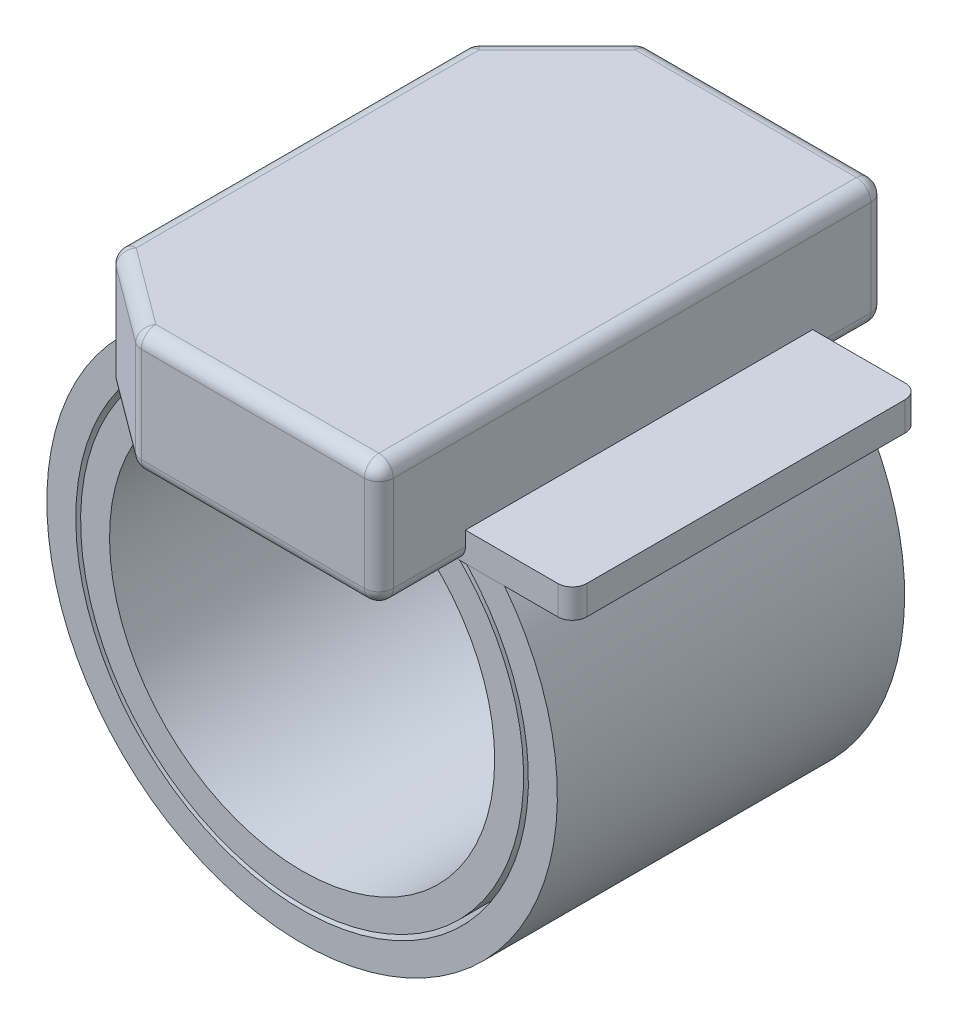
ISO-10303-21;
HEADER;
FILE_DESCRIPTION(('STEP AP214'),'2;1');
FILE_NAME('part.step','',(''),(''),'','','');
FILE_SCHEMA(('AUTOMOTIVE_DESIGN { 1 0 10303 214 1 1 1 1 }'));
ENDSEC;
DATA;
#1=APPLICATION_CONTEXT('core data for automotive mechanical design processes');
#2=APPLICATION_PROTOCOL_DEFINITION('international standard','automotive_design',2000,#1);
#3=PRODUCT_CONTEXT('',#1,'mechanical');
#4=PRODUCT('Part','Part','',(#3));
#5=PRODUCT_RELATED_PRODUCT_CATEGORY('part','',(#4));
#6=PRODUCT_DEFINITION_FORMATION('','',#4);
#7=PRODUCT_DEFINITION_CONTEXT('part definition',#1,'design');
#8=PRODUCT_DEFINITION('design','',#6,#7);
#9=PRODUCT_DEFINITION_SHAPE('','',#8);
#10=(LENGTH_UNIT() NAMED_UNIT(*) SI_UNIT(.MILLI.,.METRE.));
#11=(NAMED_UNIT(*) PLANE_ANGLE_UNIT() SI_UNIT($,.RADIAN.));
#12=(NAMED_UNIT(*) SI_UNIT($,.STERADIAN.) SOLID_ANGLE_UNIT());
#13=UNCERTAINTY_MEASURE_WITH_UNIT(LENGTH_MEASURE(1.E-05),#10,'distance_accuracy_value','');
#14=(GEOMETRIC_REPRESENTATION_CONTEXT(3) GLOBAL_UNCERTAINTY_ASSIGNED_CONTEXT((#13)) GLOBAL_UNIT_ASSIGNED_CONTEXT((#10,
#11,#12)) REPRESENTATION_CONTEXT('',''));
#15=CARTESIAN_POINT('',(0.,0.,0.));
#16=DIRECTION('',(0.,0.,1.));
#17=DIRECTION('',(1.,0.,0.));
#18=AXIS2_PLACEMENT_3D('',#15,#16,#17);
#19=CARTESIAN_POINT('',(-4.30313424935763,3.99798118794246,3.4500210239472));
#20=DIRECTION('',(-1.,0.,0.));
#21=DIRECTION('',(0.,-1.,0.));
#22=AXIS2_PLACEMENT_3D('',#19,#20,#21);
#23=PLANE('',#22);
#24=DIRECTION('',(0.,-1.,0.));
#25=VECTOR('',#24,1.);
#26=CARTESIAN_POINT('',(-4.30313424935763,3.99798118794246,-2.69835221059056));
#27=LINE('',#26,#25);
#28=CARTESIAN_POINT('',(-4.30313424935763,3.74398118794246,-2.69835221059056));
#29=VERTEX_POINT('',#28);
#30=CARTESIAN_POINT('',(-4.30313424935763,2.06860697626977,-2.69835221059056));
#31=VERTEX_POINT('',#30);
#32=EDGE_CURVE('P0_E206',#29,#31,#27,.T.);
#33=ORIENTED_EDGE('',*,*,#32,.T.);
#34=DIRECTION('',(0.,0.,1.));
#35=VECTOR('',#34,1.);
#36=CARTESIAN_POINT('',(-4.30313424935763,2.06860697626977,3.4500210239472));
#37=LINE('',#36,#35);
#38=CARTESIAN_POINT('',(-4.30313424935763,2.06860697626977,3.32218450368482));
#39=VERTEX_POINT('',#38);
#40=EDGE_CURVE('P0_E211',#31,#39,#37,.T.);
#41=ORIENTED_EDGE('',*,*,#40,.T.);
#42=DIRECTION('',(0.,-1.,0.));
#43=VECTOR('',#42,1.);
#44=CARTESIAN_POINT('',(-4.30313424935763,3.99798118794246,3.32218450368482));
#45=LINE('',#44,#43);
#46=CARTESIAN_POINT('',(-4.30313424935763,3.74398118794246,3.32218450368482));
#47=VERTEX_POINT('',#46);
#48=EDGE_CURVE('P0_E208',#39,#47,#45,.F.);
#49=ORIENTED_EDGE('',*,*,#48,.T.);
#50=DIRECTION('',(0.,0.,-1.));
#51=VECTOR('',#50,1.);
#52=CARTESIAN_POINT('',(-4.30313424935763,3.74398118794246,-2.80340980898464));
#53=LINE('',#52,#51);
#54=EDGE_CURVE('P0_E204',#47,#29,#53,.T.);
#55=ORIENTED_EDGE('',*,*,#54,.T.);
#56=EDGE_LOOP('',(#33,#41,#49,#55));
#57=FACE_BOUND('',#56,.T.);
#58=ADVANCED_FACE('P0_F16',(#57),#23,.T.);
#59=CARTESIAN_POINT('',(-2.79714775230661,3.99798118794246,4.56717631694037));
#60=DIRECTION('',(-0.595781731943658,0.,0.803146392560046));
#61=DIRECTION('',(0.803146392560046,0.,0.595781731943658));
#62=AXIS2_PLACEMENT_3D('',#59,#60,#61);
#63=PLANE('',#62);
#64=DIRECTION('',(0.,-1.,0.));
#65=VECTOR('',#64,1.);
#66=CARTESIAN_POINT('',(-4.20046280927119,3.99798118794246,3.52618368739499));
#67=LINE('',#66,#65);
#68=CARTESIAN_POINT('',(-4.20046280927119,3.74398118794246,3.52618368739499));
#69=VERTEX_POINT('',#68);
#70=CARTESIAN_POINT('',(-4.20046280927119,2.06860697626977,3.52618368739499));
#71=VERTEX_POINT('',#70);
#72=EDGE_CURVE('P0_E197',#69,#71,#67,.T.);
#73=ORIENTED_EDGE('',*,*,#72,.T.);
#74=DIRECTION('',(0.803146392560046,0.,0.595781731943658));
#75=VECTOR('',#74,1.);
#76=CARTESIAN_POINT('',(-2.79714775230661,2.06860697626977,4.56717631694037));
#77=LINE('',#76,#75);
#78=CARTESIAN_POINT('',(-2.86455159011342,2.06860697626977,4.51717550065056));
#79=VERTEX_POINT('',#78);
#80=EDGE_CURVE('P0_E202',#71,#79,#77,.T.);
#81=ORIENTED_EDGE('',*,*,#80,.T.);
#82=DIRECTION('',(0.,-1.,0.));
#83=VECTOR('',#82,1.);
#84=CARTESIAN_POINT('',(-2.86455159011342,3.99798118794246,4.51717550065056));
#85=LINE('',#84,#83);
#86=CARTESIAN_POINT('',(-2.86455159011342,3.74398118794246,4.51717550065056));
#87=VERTEX_POINT('',#86);
#88=EDGE_CURVE('P0_E199',#79,#87,#85,.F.);
#89=ORIENTED_EDGE('',*,*,#88,.T.);
#90=DIRECTION('',(-0.803146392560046,0.,-0.595781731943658));
#91=VECTOR('',#90,1.);
#92=CARTESIAN_POINT('',(-4.3031342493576,3.74398118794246,3.4500210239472));
#93=LINE('',#92,#91);
#94=EDGE_CURVE('P0_E195',#87,#69,#93,.T.);
#95=ORIENTED_EDGE('',*,*,#94,.T.);
#96=EDGE_LOOP('',(#73,#81,#89,#95));
#97=FACE_BOUND('',#96,.T.);
#98=ADVANCED_FACE('P0_F428',(#97),#63,.T.);
#99=CARTESIAN_POINT('',(1.45583959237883,3.99798118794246,4.56717631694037));
#100=DIRECTION('',(0.,0.,1.));
#101=DIRECTION('',(0.,1.,0.));
#102=AXIS2_PLACEMENT_3D('',#99,#100,#101);
#103=PLANE('',#102);
#104=DIRECTION('',(0.,-1.,0.));
#105=VECTOR('',#104,1.);
#106=CARTESIAN_POINT('',(-2.71322303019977,3.99798118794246,4.56717631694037));
#107=LINE('',#106,#105);
#108=CARTESIAN_POINT('',(-2.71322303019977,3.74398118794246,4.56717631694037));
#109=VERTEX_POINT('',#108);
#110=CARTESIAN_POINT('',(-2.71322303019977,2.06860697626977,4.56717631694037));
#111=VERTEX_POINT('',#110);
#112=EDGE_CURVE('P0_E188',#109,#111,#107,.T.);
#113=ORIENTED_EDGE('',*,*,#112,.T.);
#114=DIRECTION('',(1.,0.,0.));
#115=VECTOR('',#114,1.);
#116=CARTESIAN_POINT('',(1.45583959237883,2.06860697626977,4.56717631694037));
#117=LINE('',#116,#115);
#118=CARTESIAN_POINT('',(1.20183959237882,2.06860697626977,4.56717631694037));
#119=VERTEX_POINT('',#118);
#120=EDGE_CURVE('P0_E193',#111,#119,#117,.T.);
#121=ORIENTED_EDGE('',*,*,#120,.T.);
#122=DIRECTION('',(0.,-1.,0.));
#123=VECTOR('',#122,1.);
#124=CARTESIAN_POINT('',(1.20183959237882,3.99798118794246,4.56717631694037));
#125=LINE('',#124,#123);
#126=CARTESIAN_POINT('',(1.20183959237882,3.74398118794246,4.56717631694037));
#127=VERTEX_POINT('',#126);
#128=EDGE_CURVE('P0_E190',#119,#127,#125,.F.);
#129=ORIENTED_EDGE('',*,*,#128,.T.);
#130=DIRECTION('',(-1.,0.,0.));
#131=VECTOR('',#130,1.);
#132=CARTESIAN_POINT('',(-2.79714775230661,3.74398118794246,4.56717631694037));
#133=LINE('',#132,#131);
#134=EDGE_CURVE('P0_E186',#127,#109,#133,.T.);
#135=ORIENTED_EDGE('',*,*,#134,.T.);
#136=EDGE_LOOP('',(#113,#121,#129,#135));
#137=FACE_BOUND('',#136,.T.);
#138=ADVANCED_FACE('P0_F433',(#137),#103,.T.);
#139=CARTESIAN_POINT('',(1.45583959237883,3.99798118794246,4.56717631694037));
#140=DIRECTION('',(-1.,0.,0.));
#141=DIRECTION('',(0.,-1.,0.));
#142=AXIS2_PLACEMENT_3D('',#139,#140,#141);
#143=PLANE('',#142);
#144=DIRECTION('',(0.,-1.,0.));
#145=VECTOR('',#144,1.);
#146=CARTESIAN_POINT('',(1.45583959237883,1.81460697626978,4.31317631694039));
#147=LINE('',#146,#145);
#148=CARTESIAN_POINT('',(1.45583959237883,3.74398118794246,4.31317631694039));
#149=VERTEX_POINT('',#148);
#150=CARTESIAN_POINT('',(1.45583959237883,2.06860697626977,4.31317631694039));
#151=VERTEX_POINT('',#150);
#152=EDGE_CURVE('P0_E154',#149,#151,#147,.T.);
#153=ORIENTED_EDGE('',*,*,#152,.T.);
#154=DIRECTION('',(0.,0.,-1.));
#155=VECTOR('',#154,1.);
#156=CARTESIAN_POINT('',(1.45583959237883,2.06860697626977,-4.3228236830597));
#157=LINE('',#156,#155);
#158=CARTESIAN_POINT('',(1.45583959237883,2.06860697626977,-4.06882368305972));
#159=VERTEX_POINT('',#158);
#160=EDGE_CURVE('P0_E150',#151,#159,#157,.T.);
#161=ORIENTED_EDGE('',*,*,#160,.T.);
#162=DIRECTION('',(0.,-1.,0.));
#163=VECTOR('',#162,1.);
#164=CARTESIAN_POINT('',(1.45583959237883,3.99798118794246,-4.06882368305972));
#165=LINE('',#164,#163);
#166=CARTESIAN_POINT('',(1.45583959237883,3.74398118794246,-4.06882368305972));
#167=VERTEX_POINT('',#166);
#168=EDGE_CURVE('P0_E142',#159,#167,#165,.F.);
#169=ORIENTED_EDGE('',*,*,#168,.T.);
#170=DIRECTION('',(0.,0.,-1.));
#171=VECTOR('',#170,1.);
#172=CARTESIAN_POINT('',(1.45583959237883,3.74398118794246,4.56717631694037));
#173=LINE('',#172,#171);
#174=EDGE_CURVE('P0_E147',#167,#149,#173,.F.);
#175=ORIENTED_EDGE('',*,*,#174,.T.);
#176=EDGE_LOOP('',(#153,#161,#169,#175));
#177=FACE_BOUND('',#176,.T.);
#178=ADVANCED_FACE('P0_F145',(#177),#143,.F.);
#179=CARTESIAN_POINT('',(-2.78683543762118,3.99798118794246,-4.3228236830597));
#180=DIRECTION('',(0.,0.,-1.));
#181=DIRECTION('',(0.,-1.,0.));
#182=AXIS2_PLACEMENT_3D('',#179,#180,#181);
#183=PLANE('',#182);
#184=DIRECTION('',(0.,-1.,0.));
#185=VECTOR('',#184,1.);
#186=CARTESIAN_POINT('',(1.20183959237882,1.81460697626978,-4.3228236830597));
#187=LINE('',#186,#185);
#188=CARTESIAN_POINT('',(1.20183959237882,3.74398118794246,-4.3228236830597));
#189=VERTEX_POINT('',#188);
#190=CARTESIAN_POINT('',(1.20183959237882,2.06860697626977,-4.3228236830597));
#191=VERTEX_POINT('',#190);
#192=EDGE_CURVE('P0_E161',#189,#191,#187,.T.);
#193=ORIENTED_EDGE('',*,*,#192,.T.);
#194=DIRECTION('',(-1.,0.,0.));
#195=VECTOR('',#194,1.);
#196=CARTESIAN_POINT('',(-2.78683543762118,2.06860697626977,-4.3228236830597));
#197=LINE('',#196,#195);
#198=CARTESIAN_POINT('',(-2.68147248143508,2.06860697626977,-4.3228236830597));
#199=VERTEX_POINT('',#198);
#200=EDGE_CURVE('P0_E228',#191,#199,#197,.T.);
#201=ORIENTED_EDGE('',*,*,#200,.T.);
#202=DIRECTION('',(0.,-1.,0.));
#203=VECTOR('',#202,1.);
#204=CARTESIAN_POINT('',(-2.68147248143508,3.99798118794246,-4.3228236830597));
#205=LINE('',#204,#203);
#206=CARTESIAN_POINT('',(-2.68147248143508,3.74398118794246,-4.3228236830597));
#207=VERTEX_POINT('',#206);
#208=EDGE_CURVE('P0_E225',#199,#207,#205,.F.);
#209=ORIENTED_EDGE('',*,*,#208,.T.);
#210=DIRECTION('',(1.,0.,0.));
#211=VECTOR('',#210,1.);
#212=CARTESIAN_POINT('',(1.45583959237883,3.74398118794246,-4.3228236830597));
#213=LINE('',#212,#211);
#214=EDGE_CURVE('P0_E222',#207,#189,#213,.T.);
#215=ORIENTED_EDGE('',*,*,#214,.T.);
#216=EDGE_LOOP('',(#193,#201,#209,#215));
#217=FACE_BOUND('',#216,.T.);
#218=ADVANCED_FACE('P0_F645',(#217),#183,.T.);
#219=CARTESIAN_POINT('',(-4.30313424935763,3.99798118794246,-2.80340980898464));
#220=DIRECTION('',(-0.707831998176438,0.,-0.706380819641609));
#221=DIRECTION('',(-0.706380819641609,0.,0.707831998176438));
#222=AXIS2_PLACEMENT_3D('',#219,#220,#221);
#223=PLANE('',#222);
#224=DIRECTION('',(0.,-1.,0.));
#225=VECTOR('',#224,1.);
#226=CARTESIAN_POINT('',(-2.86126180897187,3.99798118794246,-4.2482444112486));
#227=LINE('',#226,#225);
#228=CARTESIAN_POINT('',(-2.86126180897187,3.74398118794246,-4.2482444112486));
#229=VERTEX_POINT('',#228);
#230=CARTESIAN_POINT('',(-2.86126180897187,2.06860697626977,-4.2482444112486));
#231=VERTEX_POINT('',#230);
#232=EDGE_CURVE('P0_E215',#229,#231,#227,.T.);
#233=ORIENTED_EDGE('',*,*,#232,.T.);
#234=DIRECTION('',(-0.706380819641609,0.,0.707831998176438));
#235=VECTOR('',#234,1.);
#236=CARTESIAN_POINT('',(-4.30313424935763,2.06860697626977,-2.80340980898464));
#237=LINE('',#236,#235);
#238=CARTESIAN_POINT('',(-4.2289235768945,2.06860697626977,-2.87777293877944));
#239=VERTEX_POINT('',#238);
#240=EDGE_CURVE('P0_E220',#231,#239,#237,.T.);
#241=ORIENTED_EDGE('',*,*,#240,.T.);
#242=DIRECTION('',(0.,-1.,0.));
#243=VECTOR('',#242,1.);
#244=CARTESIAN_POINT('',(-4.2289235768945,3.99798118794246,-2.87777293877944));
#245=LINE('',#244,#243);
#246=CARTESIAN_POINT('',(-4.22892357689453,3.74398118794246,-2.87777293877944));
#247=VERTEX_POINT('',#246);
#248=EDGE_CURVE('P0_E217',#239,#247,#245,.F.);
#249=ORIENTED_EDGE('',*,*,#248,.T.);
#250=DIRECTION('',(0.706380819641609,0.,-0.707831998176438));
#251=VECTOR('',#250,1.);
#252=CARTESIAN_POINT('',(-2.78683543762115,3.74398118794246,-4.3228236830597));
#253=LINE('',#252,#251);
#254=EDGE_CURVE('P0_E213',#247,#229,#253,.T.);
#255=ORIENTED_EDGE('',*,*,#254,.T.);
#256=EDGE_LOOP('',(#233,#241,#249,#255));
#257=FACE_BOUND('',#256,.T.);
#258=ADVANCED_FACE('P0_F381',(#257),#223,.T.);
#259=CARTESIAN_POINT('',(-4.30313424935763,3.99798118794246,-4.3228236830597));
#260=DIRECTION('',(0.,-1.,0.));
#261=DIRECTION('',(1.,0.,0.));
#262=AXIS2_PLACEMENT_3D('',#259,#260,#261);
#263=PLANE('',#262);
#264=DIRECTION('',(0.,0.,-1.));
#265=VECTOR('',#264,1.);
#266=CARTESIAN_POINT('',(1.20183959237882,3.99798118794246,-4.3228236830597));
#267=LINE('',#266,#265);
#268=CARTESIAN_POINT('',(1.20183959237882,3.99798118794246,4.31317631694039));
#269=VERTEX_POINT('',#268);
#270=CARTESIAN_POINT('',(1.20183959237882,3.99798118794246,-4.06882368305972));
#271=VERTEX_POINT('',#270);
#272=EDGE_CURVE('P0_E243',#269,#271,#267,.T.);
#273=ORIENTED_EDGE('',*,*,#272,.T.);
#274=DIRECTION('',(1.,0.,0.));
#275=VECTOR('',#274,1.);
#276=CARTESIAN_POINT('',(-2.78683543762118,3.99798118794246,-4.06882368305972));
#277=LINE('',#276,#275);
#278=CARTESIAN_POINT('',(-2.68147248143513,3.99798118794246,-4.06882368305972));
#279=VERTEX_POINT('',#278);
#280=EDGE_CURVE('P0_E11',#271,#279,#277,.F.);
#281=ORIENTED_EDGE('',*,*,#280,.T.);
#282=DIRECTION('',(0.706380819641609,0.,-0.707831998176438));
#283=VECTOR('',#282,1.);
#284=CARTESIAN_POINT('',(-4.12334492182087,3.99798118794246,-2.62398908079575));
#285=LINE('',#284,#283);
#286=CARTESIAN_POINT('',(-4.04913424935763,3.99798118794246,-2.69835221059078));
#287=VERTEX_POINT('',#286);
#288=EDGE_CURVE('P0_E25',#279,#287,#285,.F.);
#289=ORIENTED_EDGE('',*,*,#288,.T.);
#290=DIRECTION('',(0.,0.,-1.));
#291=VECTOR('',#290,1.);
#292=CARTESIAN_POINT('',(-4.04913424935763,3.99798118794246,3.4500210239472));
#293=LINE('',#292,#291);
#294=CARTESIAN_POINT('',(-4.0491342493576,3.99798118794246,3.32218450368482));
#295=VERTEX_POINT('',#294);
#296=EDGE_CURVE('P0_E249',#287,#295,#293,.F.);
#297=ORIENTED_EDGE('',*,*,#296,.T.);
#298=DIRECTION('',(-0.803146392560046,0.,-0.595781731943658));
#299=VECTOR('',#298,1.);
#300=CARTESIAN_POINT('',(-2.64581919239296,3.99798118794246,4.3631771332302));
#301=LINE('',#300,#299);
#302=CARTESIAN_POINT('',(-2.7132230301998,3.99798118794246,4.31317631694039));
#303=VERTEX_POINT('',#302);
#304=EDGE_CURVE('P0_E247',#295,#303,#301,.F.);
#305=ORIENTED_EDGE('',*,*,#304,.T.);
#306=DIRECTION('',(-1.,0.,0.));
#307=VECTOR('',#306,1.);
#308=CARTESIAN_POINT('',(1.45583959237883,3.99798118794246,4.31317631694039));
#309=LINE('',#308,#307);
#310=EDGE_CURVE('P0_E245',#303,#269,#309,.F.);
#311=ORIENTED_EDGE('',*,*,#310,.T.);
#312=EDGE_LOOP('',(#273,#281,#289,#297,#305,#311));
#313=FACE_BOUND('',#312,.T.);
#314=ADVANCED_FACE('P0_F632',(#313),#263,.F.);
#315=CARTESIAN_POINT('',(1.45583959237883,1.81460697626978,-4.3228236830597));
#316=DIRECTION('',(0.,-1.,0.));
#317=DIRECTION('',(1.,0.,0.));
#318=AXIS2_PLACEMENT_3D('',#315,#316,#317);
#319=PLANE('',#318);
#320=DIRECTION('',(1.,0.,0.));
#321=VECTOR('',#320,1.);
#322=CARTESIAN_POINT('',(1.45583959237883,1.81460697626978,4.31317631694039));
#323=LINE('',#322,#321);
#324=CARTESIAN_POINT('',(1.20183959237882,1.81460697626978,4.31317631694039));
#325=VERTEX_POINT('',#324);
#326=CARTESIAN_POINT('',(-2.7132230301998,1.81460697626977,4.31317631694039));
#327=VERTEX_POINT('',#326);
#328=EDGE_CURVE('P0_E238',#325,#327,#323,.F.);
#329=ORIENTED_EDGE('',*,*,#328,.T.);
#330=DIRECTION('',(0.803146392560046,0.,0.595781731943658));
#331=VECTOR('',#330,1.);
#332=CARTESIAN_POINT('',(-4.1563192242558,1.81460697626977,3.24267365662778));
#333=LINE('',#332,#331);
#334=CARTESIAN_POINT('',(-4.04913424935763,1.81460697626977,3.32218450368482));
#335=VERTEX_POINT('',#334);
#336=EDGE_CURVE('P0_E240',#327,#335,#333,.F.);
#337=ORIENTED_EDGE('',*,*,#336,.T.);
#338=DIRECTION('',(0.,0.,1.));
#339=VECTOR('',#338,1.);
#340=CARTESIAN_POINT('',(-4.04913424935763,1.81460697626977,-4.3228236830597));
#341=LINE('',#340,#339);
#342=CARTESIAN_POINT('',(-4.04913424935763,1.81460697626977,-2.69835221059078));
#343=VERTEX_POINT('',#342);
#344=EDGE_CURVE('P0_E230',#335,#343,#341,.F.);
#345=ORIENTED_EDGE('',*,*,#344,.T.);
#346=DIRECTION('',(-0.706380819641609,0.,0.707831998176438));
#347=VECTOR('',#346,1.);
#348=CARTESIAN_POINT('',(-0.490062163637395,1.81460697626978,-6.26473600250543));
#349=LINE('',#348,#347);
#350=CARTESIAN_POINT('',(-2.68147248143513,1.81460697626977,-4.06882368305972));
#351=VERTEX_POINT('',#350);
#352=EDGE_CURVE('P0_E232',#343,#351,#349,.F.);
#353=ORIENTED_EDGE('',*,*,#352,.T.);
#354=DIRECTION('',(-1.,0.,0.));
#355=VECTOR('',#354,1.);
#356=CARTESIAN_POINT('',(1.45583959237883,1.81460697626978,-4.06882368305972));
#357=LINE('',#356,#355);
#358=CARTESIAN_POINT('',(1.20183959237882,1.81460697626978,-4.06882368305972));
#359=VERTEX_POINT('',#358);
#360=EDGE_CURVE('P0_E234',#351,#359,#357,.F.);
#361=ORIENTED_EDGE('',*,*,#360,.T.);
#362=DIRECTION('',(0.,0.,-1.));
#363=VECTOR('',#362,1.);
#364=CARTESIAN_POINT('',(1.20183959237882,1.81460697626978,4.56717631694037));
#365=LINE('',#364,#363);
#366=EDGE_CURVE('P0_E236',#359,#325,#365,.F.);
#367=ORIENTED_EDGE('',*,*,#366,.T.);
#368=EDGE_LOOP('',(#329,#337,#345,#353,#361,#367));
#369=FACE_BOUND('',#368,.T.);
#370=ADVANCED_FACE('P0_F348',(#369),#319,.T.);
#371=CARTESIAN_POINT('',(-4.04913424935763,3.99798118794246,-2.69835221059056));
#372=DIRECTION('',(0.,-1.,0.));
#373=DIRECTION('',(1.,0.,0.));
#374=AXIS2_PLACEMENT_3D('',#371,#372,#373);
#375=CYLINDRICAL_SURFACE('',#374,0.254);
#376=CARTESIAN_POINT('',(-4.04913424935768,3.74398118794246,-2.69835221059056));
#377=DIRECTION('',(0.,1.,0.));
#378=DIRECTION('',(-1.,0.,0.));
#379=AXIS2_PLACEMENT_3D('',#376,#377,#378);
#380=CIRCLE('',#379,0.254);
#381=EDGE_CURVE('P0_E20',#247,#29,#380,.T.);
#382=ORIENTED_EDGE('',*,*,#381,.F.);
#383=ORIENTED_EDGE('',*,*,#248,.F.);
#384=CARTESIAN_POINT('',(-4.04913424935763,2.06860697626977,-2.69835221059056));
#385=DIRECTION('',(0.,-1.,0.));
#386=DIRECTION('',(1.,0.,0.));
#387=AXIS2_PLACEMENT_3D('',#384,#385,#386);
#388=CIRCLE('',#387,0.254);
#389=EDGE_CURVE('P0_E182',#31,#239,#388,.T.);
#390=ORIENTED_EDGE('',*,*,#389,.F.);
#391=ORIENTED_EDGE('',*,*,#32,.F.);
#392=EDGE_LOOP('',(#382,#383,#390,#391));
#393=FACE_BOUND('',#392,.T.);
#394=ADVANCED_FACE('P0_F18',(#393),#375,.T.);
#395=CARTESIAN_POINT('',(-4.04913424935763,3.74398118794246,-2.69835221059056));
#396=DIRECTION('',(0.,1.,0.));
#397=DIRECTION('',(-1.,0.,0.));
#398=AXIS2_PLACEMENT_3D('',#395,#396,#397);
#399=SPHERICAL_SURFACE('',#398,0.254);
#400=CARTESIAN_POINT('',(-4.0491342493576,3.74398118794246,-2.69835221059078));
#401=DIRECTION('',(-0.706380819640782,0.,0.707831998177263));
#402=DIRECTION('',(0.707831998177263,0.,0.706380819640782));
#403=AXIS2_PLACEMENT_3D('',#400,#401,#402);
#404=CIRCLE('',#403,0.254);
#405=EDGE_CURVE('P0_E326',#247,#287,#404,.F.);
#406=ORIENTED_EDGE('',*,*,#405,.F.);
#407=ORIENTED_EDGE('',*,*,#381,.T.);
#408=CARTESIAN_POINT('',(-4.04913424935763,3.74398118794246,-2.69835221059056));
#409=DIRECTION('',(0.,-8.74191357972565E-13,-1.));
#410=DIRECTION('',(0.,-1.,8.7420810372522E-13));
#411=AXIS2_PLACEMENT_3D('',#408,#409,#410);
#412=CIRCLE('',#411,0.254);
#413=EDGE_CURVE('P0_E328',#287,#29,#412,.F.);
#414=ORIENTED_EDGE('',*,*,#413,.F.);
#415=EDGE_LOOP('',(#406,#407,#414));
#416=FACE_BOUND('',#415,.T.);
#417=ADVANCED_FACE('P0_F375',(#416),#399,.T.);
#418=CARTESIAN_POINT('',(-4.04913424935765,2.06860697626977,-2.69835221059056));
#419=DIRECTION('',(0.,1.,0.));
#420=DIRECTION('',(-1.,0.,0.));
#421=AXIS2_PLACEMENT_3D('',#418,#419,#420);
#422=SPHERICAL_SURFACE('',#421,0.254);
#423=CARTESIAN_POINT('',(-4.04913424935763,2.06860697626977,-2.69835221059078));
#424=DIRECTION('',(-8.7419135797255E-13,0.,-1.));
#425=DIRECTION('',(-1.,0.,8.74232991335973E-13));
#426=AXIS2_PLACEMENT_3D('',#423,#424,#425);
#427=CIRCLE('',#426,0.254);
#428=EDGE_CURVE('P0_E320',#31,#343,#427,.F.);
#429=ORIENTED_EDGE('',*,*,#428,.F.);
#430=ORIENTED_EDGE('',*,*,#389,.T.);
#431=CARTESIAN_POINT('',(-4.04913424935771,2.06860697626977,-2.69835221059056));
#432=DIRECTION('',(-0.706380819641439,-9.27541521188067E-13,0.707831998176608));
#433=DIRECTION('',(0.707831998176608,0.,0.706380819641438));
#434=AXIS2_PLACEMENT_3D('',#431,#432,#433);
#435=CIRCLE('',#434,0.254);
#436=EDGE_CURVE('P0_E323',#343,#239,#435,.F.);
#437=ORIENTED_EDGE('',*,*,#436,.F.);
#438=EDGE_LOOP('',(#429,#430,#437));
#439=FACE_BOUND('',#438,.T.);
#440=ADVANCED_FACE('P0_F335',(#439),#422,.T.);
#441=CARTESIAN_POINT('',(-4.04913424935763,3.74398118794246,3.4500210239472));
#442=DIRECTION('',(0.,0.,1.));
#443=DIRECTION('',(0.,1.,0.));
#444=AXIS2_PLACEMENT_3D('',#441,#442,#443);
#445=CYLINDRICAL_SURFACE('',#444,0.254);
#446=ORIENTED_EDGE('',*,*,#413,.T.);
#447=ORIENTED_EDGE('',*,*,#54,.F.);
#448=CARTESIAN_POINT('',(-4.04913424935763,3.74398118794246,3.32218450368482));
#449=DIRECTION('',(0.,0.,1.));
#450=DIRECTION('',(0.,1.,0.));
#451=AXIS2_PLACEMENT_3D('',#448,#449,#450);
#452=CIRCLE('',#451,0.254);
#453=EDGE_CURVE('P0_E315',#295,#47,#452,.T.);
#454=ORIENTED_EDGE('',*,*,#453,.F.);
#455=ORIENTED_EDGE('',*,*,#296,.F.);
#456=EDGE_LOOP('',(#446,#447,#454,#455));
#457=FACE_BOUND('',#456,.T.);
#458=ADVANCED_FACE('P0_F369',(#457),#445,.T.);
#459=CARTESIAN_POINT('',(-4.12334492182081,3.74398118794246,-2.62398908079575));
#460=DIRECTION('',(-0.706380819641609,0.,0.707831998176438));
#461=DIRECTION('',(0.707831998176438,0.,0.706380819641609));
#462=AXIS2_PLACEMENT_3D('',#459,#460,#461);
#463=CYLINDRICAL_SURFACE('',#462,0.254);
#464=ORIENTED_EDGE('',*,*,#405,.T.);
#465=ORIENTED_EDGE('',*,*,#288,.F.);
#466=CARTESIAN_POINT('',(-2.68147248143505,3.74398118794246,-4.06882368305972));
#467=DIRECTION('',(0.706380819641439,2.31571904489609E-13,-0.707831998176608));
#468=DIRECTION('',(-0.707831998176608,0.,-0.706380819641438));
#469=AXIS2_PLACEMENT_3D('',#466,#467,#468);
#470=CIRCLE('',#469,0.254);
#471=EDGE_CURVE('P0_E313',#229,#279,#470,.T.);
#472=ORIENTED_EDGE('',*,*,#471,.F.);
#473=ORIENTED_EDGE('',*,*,#254,.F.);
#474=EDGE_LOOP('',(#464,#465,#472,#473));
#475=FACE_BOUND('',#474,.T.);
#476=ADVANCED_FACE('P0_F377',(#475),#463,.T.);
#477=CARTESIAN_POINT('',(-2.68147248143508,3.99798118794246,-4.06882368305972));
#478=DIRECTION('',(0.,-1.,0.));
#479=DIRECTION('',(1.,0.,0.));
#480=AXIS2_PLACEMENT_3D('',#477,#478,#479);
#481=CYLINDRICAL_SURFACE('',#480,0.254);
#482=CARTESIAN_POINT('',(-2.68147248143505,2.06860697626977,-4.06882368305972));
#483=DIRECTION('',(0.,-1.,0.));
#484=DIRECTION('',(1.,0.,0.));
#485=AXIS2_PLACEMENT_3D('',#482,#483,#484);
#486=CIRCLE('',#485,0.254);
#487=EDGE_CURVE('P0_E307',#231,#199,#486,.T.);
#488=ORIENTED_EDGE('',*,*,#487,.F.);
#489=ORIENTED_EDGE('',*,*,#232,.F.);
#490=CARTESIAN_POINT('',(-2.68147248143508,3.74398118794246,-4.06882368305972));
#491=DIRECTION('',(0.,1.,0.));
#492=DIRECTION('',(-1.,0.,0.));
#493=AXIS2_PLACEMENT_3D('',#490,#491,#492);
#494=CIRCLE('',#493,0.254);
#495=EDGE_CURVE('P0_E310',#207,#229,#494,.T.);
#496=ORIENTED_EDGE('',*,*,#495,.F.);
#497=ORIENTED_EDGE('',*,*,#208,.F.);
#498=EDGE_LOOP('',(#488,#489,#496,#497));
#499=FACE_BOUND('',#498,.T.);
#500=ADVANCED_FACE('P0_F384',(#499),#481,.T.);
#501=CARTESIAN_POINT('',(-4.12334492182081,2.06860697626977,-2.62398908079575));
#502=DIRECTION('',(-0.706380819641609,0.,0.707831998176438));
#503=DIRECTION('',(0.707831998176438,0.,0.706380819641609));
#504=AXIS2_PLACEMENT_3D('',#501,#502,#503);
#505=CYLINDRICAL_SURFACE('',#504,0.254);
#506=ORIENTED_EDGE('',*,*,#436,.T.);
#507=ORIENTED_EDGE('',*,*,#240,.F.);
#508=CARTESIAN_POINT('',(-2.68147248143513,2.06860697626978,-4.06882368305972));
#509=DIRECTION('',(0.706380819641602,0.,-0.707831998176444));
#510=DIRECTION('',(-0.707831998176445,0.,-0.706380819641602));
#511=AXIS2_PLACEMENT_3D('',#508,#509,#510);
#512=CIRCLE('',#511,0.254);
#513=EDGE_CURVE('P0_E304',#351,#231,#512,.T.);
#514=ORIENTED_EDGE('',*,*,#513,.F.);
#515=ORIENTED_EDGE('',*,*,#352,.F.);
#516=EDGE_LOOP('',(#506,#507,#514,#515));
#517=FACE_BOUND('',#516,.T.);
#518=ADVANCED_FACE('P0_F343',(#517),#505,.T.);
#519=CARTESIAN_POINT('',(-4.04913424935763,2.06860697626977,3.4500210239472));
#520=DIRECTION('',(0.,0.,1.));
#521=DIRECTION('',(0.,1.,0.));
#522=AXIS2_PLACEMENT_3D('',#519,#520,#521);
#523=CYLINDRICAL_SURFACE('',#522,0.254);
#524=ORIENTED_EDGE('',*,*,#428,.T.);
#525=ORIENTED_EDGE('',*,*,#344,.F.);
#526=CARTESIAN_POINT('',(-4.04913424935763,2.06860697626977,3.32218450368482));
#527=DIRECTION('',(0.,0.,1.));
#528=DIRECTION('',(0.,1.,0.));
#529=AXIS2_PLACEMENT_3D('',#526,#527,#528);
#530=CIRCLE('',#529,0.254);
#531=EDGE_CURVE('P0_E301',#39,#335,#530,.T.);
#532=ORIENTED_EDGE('',*,*,#531,.F.);
#533=ORIENTED_EDGE('',*,*,#40,.F.);
#534=EDGE_LOOP('',(#524,#525,#532,#533));
#535=FACE_BOUND('',#534,.T.);
#536=ADVANCED_FACE('P0_F355',(#535),#523,.T.);
#537=CARTESIAN_POINT('',(-4.04913424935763,3.99798118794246,3.32218450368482));
#538=DIRECTION('',(0.,-1.,0.));
#539=DIRECTION('',(1.,0.,0.));
#540=AXIS2_PLACEMENT_3D('',#537,#538,#539);
#541=CYLINDRICAL_SURFACE('',#540,0.254);
#542=CARTESIAN_POINT('',(-4.04913424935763,3.74398118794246,3.32218450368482));
#543=DIRECTION('',(0.,1.,0.));
#544=DIRECTION('',(-1.,0.,0.));
#545=AXIS2_PLACEMENT_3D('',#542,#543,#544);
#546=CIRCLE('',#545,0.254);
#547=EDGE_CURVE('P0_E317',#47,#69,#546,.T.);
#548=ORIENTED_EDGE('',*,*,#547,.F.);
#549=ORIENTED_EDGE('',*,*,#48,.F.);
#550=CARTESIAN_POINT('',(-4.04913424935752,2.06860697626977,3.32218450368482));
#551=DIRECTION('',(0.,-1.,0.));
#552=DIRECTION('',(1.,0.,0.));
#553=AXIS2_PLACEMENT_3D('',#550,#551,#552);
#554=CIRCLE('',#553,0.254);
#555=EDGE_CURVE('P0_E298',#71,#39,#554,.T.);
#556=ORIENTED_EDGE('',*,*,#555,.F.);
#557=ORIENTED_EDGE('',*,*,#72,.F.);
#558=EDGE_LOOP('',(#548,#549,#556,#557));
#559=FACE_BOUND('',#558,.T.);
#560=ADVANCED_FACE('P0_F361',(#559),#541,.T.);
#561=CARTESIAN_POINT('',(-4.04913424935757,3.74398118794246,3.32218450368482));
#562=DIRECTION('',(0.,1.,0.));
#563=DIRECTION('',(-1.,0.,0.));
#564=AXIS2_PLACEMENT_3D('',#561,#562,#563);
#565=SPHERICAL_SURFACE('',#564,0.254);
#566=ORIENTED_EDGE('',*,*,#453,.T.);
#567=ORIENTED_EDGE('',*,*,#547,.T.);
#568=CARTESIAN_POINT('',(-4.04913424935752,3.74398118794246,3.32218450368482));
#569=DIRECTION('',(-0.803146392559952,-2.63294436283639E-13,-0.595781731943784));
#570=DIRECTION('',(-0.595781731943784,0.,0.803146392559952));
#571=AXIS2_PLACEMENT_3D('',#568,#569,#570);
#572=CIRCLE('',#571,0.254);
#573=EDGE_CURVE('P0_E295',#295,#69,#572,.F.);
#574=ORIENTED_EDGE('',*,*,#573,.F.);
#575=EDGE_LOOP('',(#566,#567,#574));
#576=FACE_BOUND('',#575,.T.);
#577=ADVANCED_FACE('P0_F566',(#576),#565,.T.);
#578=CARTESIAN_POINT('',(-2.68147248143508,3.74398118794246,-4.06882368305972));
#579=DIRECTION('',(0.,1.,0.));
#580=DIRECTION('',(-1.,0.,0.));
#581=AXIS2_PLACEMENT_3D('',#578,#579,#580);
#582=SPHERICAL_SURFACE('',#581,0.254);
#583=ORIENTED_EDGE('',*,*,#495,.T.);
#584=ORIENTED_EDGE('',*,*,#471,.T.);
#585=CARTESIAN_POINT('',(-2.68147248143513,3.74398118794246,-4.06882368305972));
#586=DIRECTION('',(-1.,0.,-2.18506206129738E-13));
#587=DIRECTION('',(-2.18547839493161E-13,0.,1.));
#588=AXIS2_PLACEMENT_3D('',#585,#586,#587);
#589=CIRCLE('',#588,0.254);
#590=EDGE_CURVE('P0_E33',#207,#279,#589,.F.);
#591=ORIENTED_EDGE('',*,*,#590,.F.);
#592=EDGE_LOOP('',(#583,#584,#591));
#593=FACE_BOUND('',#592,.T.);
#594=ADVANCED_FACE('P0_F425',(#593),#582,.T.);
#595=CARTESIAN_POINT('',(-2.68147248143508,2.06860697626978,-4.06882368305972));
#596=DIRECTION('',(0.,1.,0.));
#597=DIRECTION('',(-1.,0.,0.));
#598=AXIS2_PLACEMENT_3D('',#595,#596,#597);
#599=SPHERICAL_SURFACE('',#598,0.254);
#600=ORIENTED_EDGE('',*,*,#513,.T.);
#601=ORIENTED_EDGE('',*,*,#487,.T.);
#602=CARTESIAN_POINT('',(-2.68147248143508,2.06860697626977,-4.06882368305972));
#603=DIRECTION('',(-1.,2.18540900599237E-13,0.));
#604=DIRECTION('',(-2.18562383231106E-13,-1.,0.));
#605=AXIS2_PLACEMENT_3D('',#602,#603,#604);
#606=CIRCLE('',#605,0.254);
#607=EDGE_CURVE('P0_E291',#351,#199,#606,.F.);
#608=ORIENTED_EDGE('',*,*,#607,.F.);
#609=EDGE_LOOP('',(#600,#601,#608));
#610=FACE_BOUND('',#609,.T.);
#611=ADVANCED_FACE('P0_F387',(#610),#599,.T.);
#612=CARTESIAN_POINT('',(-4.04913424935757,2.06860697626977,3.32218450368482));
#613=DIRECTION('',(0.,1.,0.));
#614=DIRECTION('',(-1.,0.,0.));
#615=AXIS2_PLACEMENT_3D('',#612,#613,#614);
#616=SPHERICAL_SURFACE('',#615,0.254);
#617=ORIENTED_EDGE('',*,*,#555,.T.);
#618=ORIENTED_EDGE('',*,*,#531,.T.);
#619=CARTESIAN_POINT('',(-4.0491342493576,2.06860697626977,3.32218450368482));
#620=DIRECTION('',(-0.803146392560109,0.,-0.595781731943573));
#621=DIRECTION('',(-0.595781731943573,0.,0.803146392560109));
#622=AXIS2_PLACEMENT_3D('',#619,#620,#621);
#623=CIRCLE('',#622,0.254);
#624=EDGE_CURVE('P0_E289',#71,#335,#623,.F.);
#625=ORIENTED_EDGE('',*,*,#624,.F.);
#626=EDGE_LOOP('',(#617,#618,#625));
#627=FACE_BOUND('',#626,.T.);
#628=ADVANCED_FACE('P0_F413',(#627),#616,.T.);
#629=CARTESIAN_POINT('',(-2.64581919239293,3.74398118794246,4.3631771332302));
#630=DIRECTION('',(0.803146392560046,0.,0.595781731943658));
#631=DIRECTION('',(0.595781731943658,0.,-0.803146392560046));
#632=AXIS2_PLACEMENT_3D('',#629,#630,#631);
#633=CYLINDRICAL_SURFACE('',#632,0.254);
#634=ORIENTED_EDGE('',*,*,#573,.T.);
#635=ORIENTED_EDGE('',*,*,#94,.F.);
#636=CARTESIAN_POINT('',(-2.7132230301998,3.74398118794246,4.31317631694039));
#637=DIRECTION('',(0.803146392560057,0.,0.595781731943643));
#638=DIRECTION('',(0.595781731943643,0.,-0.803146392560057));
#639=AXIS2_PLACEMENT_3D('',#636,#637,#638);
#640=CIRCLE('',#639,0.254);
#641=EDGE_CURVE('P0_E284',#303,#87,#640,.T.);
#642=ORIENTED_EDGE('',*,*,#641,.F.);
#643=ORIENTED_EDGE('',*,*,#304,.F.);
#644=EDGE_LOOP('',(#634,#635,#642,#643));
#645=FACE_BOUND('',#644,.T.);
#646=ADVANCED_FACE('P0_F415',(#645),#633,.T.);
#647=CARTESIAN_POINT('',(-2.78683543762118,3.74398118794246,-4.06882368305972));
#648=DIRECTION('',(-1.,0.,0.));
#649=DIRECTION('',(0.,-1.,0.));
#650=AXIS2_PLACEMENT_3D('',#647,#648,#649);
#651=CYLINDRICAL_SURFACE('',#650,0.254);
#652=ORIENTED_EDGE('',*,*,#590,.T.);
#653=ORIENTED_EDGE('',*,*,#280,.F.);
#654=CARTESIAN_POINT('',(1.20183959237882,3.74398118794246,-4.06882368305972));
#655=DIRECTION('',(1.,0.,0.));
#656=DIRECTION('',(0.,1.,0.));
#657=AXIS2_PLACEMENT_3D('',#654,#655,#656);
#658=CIRCLE('',#657,0.254);
#659=EDGE_CURVE('P0_E165',#189,#271,#658,.T.);
#660=ORIENTED_EDGE('',*,*,#659,.F.);
#661=ORIENTED_EDGE('',*,*,#214,.F.);
#662=EDGE_LOOP('',(#652,#653,#660,#661));
#663=FACE_BOUND('',#662,.T.);
#664=ADVANCED_FACE('P0_F422',(#663),#651,.T.);
#665=CARTESIAN_POINT('',(1.20183959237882,3.99798118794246,-4.06882368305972));
#666=DIRECTION('',(0.,1.,0.));
#667=DIRECTION('',(-1.,0.,0.));
#668=AXIS2_PLACEMENT_3D('',#665,#666,#667);
#669=CYLINDRICAL_SURFACE('',#668,0.254);
#670=CARTESIAN_POINT('',(1.20183959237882,2.06860697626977,-4.06882368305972));
#671=DIRECTION('',(0.,-1.,0.));
#672=DIRECTION('',(1.,0.,0.));
#673=AXIS2_PLACEMENT_3D('',#670,#671,#672);
#674=CIRCLE('',#673,0.254);
#675=EDGE_CURVE('P0_E166',#191,#159,#674,.T.);
#676=ORIENTED_EDGE('',*,*,#675,.F.);
#677=ORIENTED_EDGE('',*,*,#192,.F.);
#678=CARTESIAN_POINT('',(1.20183959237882,3.74398118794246,-4.06882368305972));
#679=DIRECTION('',(0.,1.,0.));
#680=DIRECTION('',(-1.,0.,0.));
#681=AXIS2_PLACEMENT_3D('',#678,#679,#680);
#682=CIRCLE('',#681,0.254);
#683=EDGE_CURVE('P0_E158',#167,#189,#682,.T.);
#684=ORIENTED_EDGE('',*,*,#683,.F.);
#685=ORIENTED_EDGE('',*,*,#168,.F.);
#686=EDGE_LOOP('',(#676,#677,#684,#685));
#687=FACE_BOUND('',#686,.T.);
#688=ADVANCED_FACE('P0_F160',(#687),#669,.T.);
#689=CARTESIAN_POINT('',(-2.78683543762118,2.06860697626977,-4.06882368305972));
#690=DIRECTION('',(-1.,0.,0.));
#691=DIRECTION('',(0.,-1.,0.));
#692=AXIS2_PLACEMENT_3D('',#689,#690,#691);
#693=CYLINDRICAL_SURFACE('',#692,0.254);
#694=ORIENTED_EDGE('',*,*,#607,.T.);
#695=ORIENTED_EDGE('',*,*,#200,.F.);
#696=CARTESIAN_POINT('',(1.20183959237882,2.06860697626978,-4.06882368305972));
#697=DIRECTION('',(1.,0.,0.));
#698=DIRECTION('',(0.,1.,0.));
#699=AXIS2_PLACEMENT_3D('',#696,#697,#698);
#700=CIRCLE('',#699,0.254);
#701=EDGE_CURVE('P0_E279',#359,#191,#700,.T.);
#702=ORIENTED_EDGE('',*,*,#701,.F.);
#703=ORIENTED_EDGE('',*,*,#360,.F.);
#704=EDGE_LOOP('',(#694,#695,#702,#703));
#705=FACE_BOUND('',#704,.T.);
#706=ADVANCED_FACE('P0_F390',(#705),#693,.T.);
#707=CARTESIAN_POINT('',(-2.64581919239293,2.06860697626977,4.3631771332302));
#708=DIRECTION('',(0.803146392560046,0.,0.595781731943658));
#709=DIRECTION('',(0.595781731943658,0.,-0.803146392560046));
#710=AXIS2_PLACEMENT_3D('',#707,#708,#709);
#711=CYLINDRICAL_SURFACE('',#710,0.254);
#712=ORIENTED_EDGE('',*,*,#624,.T.);
#713=ORIENTED_EDGE('',*,*,#336,.F.);
#714=CARTESIAN_POINT('',(-2.71322303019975,2.06860697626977,4.31317631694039));
#715=DIRECTION('',(0.803146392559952,-1.75520335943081E-13,0.595781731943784));
#716=DIRECTION('',(0.595781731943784,0.,-0.803146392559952));
#717=AXIS2_PLACEMENT_3D('',#714,#715,#716);
#718=CIRCLE('',#717,0.254);
#719=EDGE_CURVE('P0_E276',#79,#327,#718,.T.);
#720=ORIENTED_EDGE('',*,*,#719,.F.);
#721=ORIENTED_EDGE('',*,*,#80,.F.);
#722=EDGE_LOOP('',(#712,#713,#720,#721));
#723=FACE_BOUND('',#722,.T.);
#724=ADVANCED_FACE('P0_F411',(#723),#711,.T.);
#725=CARTESIAN_POINT('',(-2.71322303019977,3.99798118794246,4.31317631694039));
#726=DIRECTION('',(0.,-1.,0.));
#727=DIRECTION('',(1.,0.,0.));
#728=AXIS2_PLACEMENT_3D('',#725,#726,#727);
#729=CYLINDRICAL_SURFACE('',#728,0.254);
#730=CARTESIAN_POINT('',(-2.71322303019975,3.74398118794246,4.31317631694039));
#731=DIRECTION('',(0.,1.,0.));
#732=DIRECTION('',(-1.,0.,0.));
#733=AXIS2_PLACEMENT_3D('',#730,#731,#732);
#734=CIRCLE('',#733,0.254);
#735=EDGE_CURVE('P0_E286',#87,#109,#734,.T.);
#736=ORIENTED_EDGE('',*,*,#735,.F.);
#737=ORIENTED_EDGE('',*,*,#88,.F.);
#738=CARTESIAN_POINT('',(-2.71322303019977,2.06860697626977,4.31317631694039));
#739=DIRECTION('',(0.,-1.,0.));
#740=DIRECTION('',(1.,0.,0.));
#741=AXIS2_PLACEMENT_3D('',#738,#739,#740);
#742=CIRCLE('',#741,0.254);
#743=EDGE_CURVE('P0_E273',#111,#79,#742,.T.);
#744=ORIENTED_EDGE('',*,*,#743,.F.);
#745=ORIENTED_EDGE('',*,*,#112,.F.);
#746=EDGE_LOOP('',(#736,#737,#744,#745));
#747=FACE_BOUND('',#746,.T.);
#748=ADVANCED_FACE('P0_F470',(#747),#729,.T.);
#749=CARTESIAN_POINT('',(-2.71322303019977,3.74398118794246,4.31317631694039));
#750=DIRECTION('',(0.,1.,0.));
#751=DIRECTION('',(-1.,0.,0.));
#752=AXIS2_PLACEMENT_3D('',#749,#750,#751);
#753=SPHERICAL_SURFACE('',#752,0.254);
#754=ORIENTED_EDGE('',*,*,#641,.T.);
#755=ORIENTED_EDGE('',*,*,#735,.T.);
#756=CARTESIAN_POINT('',(-2.71322303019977,3.74398118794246,4.31317631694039));
#757=DIRECTION('',(-1.,-1.09280858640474E-13,0.));
#758=DIRECTION('',(1.09259376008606E-13,-1.,0.));
#759=AXIS2_PLACEMENT_3D('',#756,#757,#758);
#760=CIRCLE('',#759,0.254);
#761=EDGE_CURVE('P0_E173',#303,#109,#760,.F.);
#762=ORIENTED_EDGE('',*,*,#761,.F.);
#763=EDGE_LOOP('',(#754,#755,#762));
#764=FACE_BOUND('',#763,.T.);
#765=ADVANCED_FACE('P0_F467',(#764),#753,.T.);
#766=CARTESIAN_POINT('',(1.20183959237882,3.74398118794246,-4.06882368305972));
#767=DIRECTION('',(0.,1.,0.));
#768=DIRECTION('',(-1.,0.,0.));
#769=AXIS2_PLACEMENT_3D('',#766,#767,#768);
#770=SPHERICAL_SURFACE('',#769,0.254);
#771=ORIENTED_EDGE('',*,*,#683,.T.);
#772=ORIENTED_EDGE('',*,*,#659,.T.);
#773=CARTESIAN_POINT('',(1.20183959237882,3.74398118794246,-4.06882368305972));
#774=DIRECTION('',(0.,0.,-1.));
#775=DIRECTION('',(0.,-1.,0.));
#776=AXIS2_PLACEMENT_3D('',#773,#774,#775);
#777=CIRCLE('',#776,0.254);
#778=EDGE_CURVE('P0_E169',#167,#271,#777,.F.);
#779=ORIENTED_EDGE('',*,*,#778,.F.);
#780=EDGE_LOOP('',(#771,#772,#779));
#781=FACE_BOUND('',#780,.T.);
#782=ADVANCED_FACE('P0_F170',(#781),#770,.T.);
#783=CARTESIAN_POINT('',(1.20183959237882,2.06860697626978,-4.06882368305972));
#784=DIRECTION('',(0.,1.,0.));
#785=DIRECTION('',(-1.,0.,0.));
#786=AXIS2_PLACEMENT_3D('',#783,#784,#785);
#787=SPHERICAL_SURFACE('',#786,0.254);
#788=ORIENTED_EDGE('',*,*,#701,.T.);
#789=ORIENTED_EDGE('',*,*,#675,.T.);
#790=CARTESIAN_POINT('',(1.20183959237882,2.06860697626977,-4.06882368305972));
#791=DIRECTION('',(0.,0.,-1.));
#792=DIRECTION('',(0.,-1.,0.));
#793=AXIS2_PLACEMENT_3D('',#790,#791,#792);
#794=CIRCLE('',#793,0.254);
#795=EDGE_CURVE('P0_E174',#359,#159,#794,.F.);
#796=ORIENTED_EDGE('',*,*,#795,.F.);
#797=EDGE_LOOP('',(#788,#789,#796));
#798=FACE_BOUND('',#797,.T.);
#799=ADVANCED_FACE('P0_F394',(#798),#787,.T.);
#800=CARTESIAN_POINT('',(-2.71322303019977,2.06860697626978,4.31317631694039));
#801=DIRECTION('',(0.,1.,0.));
#802=DIRECTION('',(-1.,0.,0.));
#803=AXIS2_PLACEMENT_3D('',#800,#801,#802);
#804=SPHERICAL_SURFACE('',#803,0.254);
#805=ORIENTED_EDGE('',*,*,#743,.T.);
#806=ORIENTED_EDGE('',*,*,#719,.T.);
#807=CARTESIAN_POINT('',(-2.7132230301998,2.06860697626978,4.31317631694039));
#808=DIRECTION('',(-1.,0.,1.09315553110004E-13));
#809=DIRECTION('',(1.09273919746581E-13,0.,1.));
#810=AXIS2_PLACEMENT_3D('',#807,#808,#809);
#811=CIRCLE('',#810,0.254);
#812=EDGE_CURVE('P0_E266',#111,#327,#811,.F.);
#813=ORIENTED_EDGE('',*,*,#812,.F.);
#814=EDGE_LOOP('',(#805,#806,#813));
#815=FACE_BOUND('',#814,.T.);
#816=ADVANCED_FACE('P0_F406',(#815),#804,.T.);
#817=CARTESIAN_POINT('',(1.45583959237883,3.74398118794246,4.31317631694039));
#818=DIRECTION('',(1.,0.,0.));
#819=DIRECTION('',(0.,1.,0.));
#820=AXIS2_PLACEMENT_3D('',#817,#818,#819);
#821=CYLINDRICAL_SURFACE('',#820,0.254);
#822=ORIENTED_EDGE('',*,*,#761,.T.);
#823=ORIENTED_EDGE('',*,*,#134,.F.);
#824=CARTESIAN_POINT('',(1.20183959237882,3.74398118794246,4.31317631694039));
#825=DIRECTION('',(1.,0.,0.));
#826=DIRECTION('',(0.,1.,0.));
#827=AXIS2_PLACEMENT_3D('',#824,#825,#826);
#828=CIRCLE('',#827,0.254);
#829=EDGE_CURVE('P0_E263',#269,#127,#828,.T.);
#830=ORIENTED_EDGE('',*,*,#829,.F.);
#831=ORIENTED_EDGE('',*,*,#310,.F.);
#832=EDGE_LOOP('',(#822,#823,#830,#831));
#833=FACE_BOUND('',#832,.T.);
#834=ADVANCED_FACE('P0_F457',(#833),#821,.T.);
#835=CARTESIAN_POINT('',(1.20183959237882,3.74398118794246,-4.3228236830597));
#836=DIRECTION('',(0.,0.,-1.));
#837=DIRECTION('',(0.,-1.,0.));
#838=AXIS2_PLACEMENT_3D('',#835,#836,#837);
#839=CYLINDRICAL_SURFACE('',#838,0.254);
#840=ORIENTED_EDGE('',*,*,#778,.T.);
#841=ORIENTED_EDGE('',*,*,#272,.F.);
#842=CARTESIAN_POINT('',(1.20183959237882,3.74398118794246,4.31317631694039));
#843=DIRECTION('',(0.,0.,1.));
#844=DIRECTION('',(0.,1.,0.));
#845=AXIS2_PLACEMENT_3D('',#842,#843,#844);
#846=CIRCLE('',#845,0.254);
#847=EDGE_CURVE('P0_E178',#149,#269,#846,.T.);
#848=ORIENTED_EDGE('',*,*,#847,.F.);
#849=ORIENTED_EDGE('',*,*,#174,.F.);
#850=EDGE_LOOP('',(#840,#841,#848,#849));
#851=FACE_BOUND('',#850,.T.);
#852=ADVANCED_FACE('P0_F176',(#851),#839,.T.);
#853=CARTESIAN_POINT('',(1.20183959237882,2.06860697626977,4.56717631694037));
#854=DIRECTION('',(0.,0.,1.));
#855=DIRECTION('',(0.,1.,0.));
#856=AXIS2_PLACEMENT_3D('',#853,#854,#855);
#857=CYLINDRICAL_SURFACE('',#856,0.254);
#858=ORIENTED_EDGE('',*,*,#795,.T.);
#859=ORIENTED_EDGE('',*,*,#160,.F.);
#860=CARTESIAN_POINT('',(1.20183959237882,2.06860697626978,4.31317631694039));
#861=DIRECTION('',(0.,0.,1.));
#862=DIRECTION('',(0.,1.,0.));
#863=AXIS2_PLACEMENT_3D('',#860,#861,#862);
#864=CIRCLE('',#863,0.254);
#865=EDGE_CURVE('P0_E259',#325,#151,#864,.T.);
#866=ORIENTED_EDGE('',*,*,#865,.F.);
#867=ORIENTED_EDGE('',*,*,#366,.F.);
#868=EDGE_LOOP('',(#858,#859,#866,#867));
#869=FACE_BOUND('',#868,.T.);
#870=ADVANCED_FACE('P0_F397',(#869),#857,.T.);
#871=CARTESIAN_POINT('',(1.45583959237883,2.06860697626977,4.31317631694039));
#872=DIRECTION('',(1.,0.,0.));
#873=DIRECTION('',(0.,1.,0.));
#874=AXIS2_PLACEMENT_3D('',#871,#872,#873);
#875=CYLINDRICAL_SURFACE('',#874,0.254);
#876=ORIENTED_EDGE('',*,*,#812,.T.);
#877=ORIENTED_EDGE('',*,*,#328,.F.);
#878=CARTESIAN_POINT('',(1.20183959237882,2.06860697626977,4.31317631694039));
#879=DIRECTION('',(1.,0.,0.));
#880=DIRECTION('',(0.,1.,0.));
#881=AXIS2_PLACEMENT_3D('',#878,#879,#880);
#882=CIRCLE('',#881,0.254);
#883=EDGE_CURVE('P0_E256',#119,#325,#882,.T.);
#884=ORIENTED_EDGE('',*,*,#883,.F.);
#885=ORIENTED_EDGE('',*,*,#120,.F.);
#886=EDGE_LOOP('',(#876,#877,#884,#885));
#887=FACE_BOUND('',#886,.T.);
#888=ADVANCED_FACE('P0_F401',(#887),#875,.T.);
#889=CARTESIAN_POINT('',(1.20183959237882,3.74398118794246,4.31317631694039));
#890=DIRECTION('',(0.,1.,0.));
#891=DIRECTION('',(-1.,0.,0.));
#892=AXIS2_PLACEMENT_3D('',#889,#890,#891);
#893=SPHERICAL_SURFACE('',#892,0.254);
#894=ORIENTED_EDGE('',*,*,#847,.T.);
#895=ORIENTED_EDGE('',*,*,#829,.T.);
#896=CARTESIAN_POINT('',(1.20183959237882,3.74398118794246,4.31317631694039));
#897=DIRECTION('',(0.,1.,0.));
#898=DIRECTION('',(-1.,0.,0.));
#899=AXIS2_PLACEMENT_3D('',#896,#897,#898);
#900=CIRCLE('',#899,0.254);
#901=EDGE_CURVE('P0_E254',#149,#127,#900,.F.);
#902=ORIENTED_EDGE('',*,*,#901,.F.);
#903=EDGE_LOOP('',(#894,#895,#902));
#904=FACE_BOUND('',#903,.T.);
#905=ADVANCED_FACE('P0_F446',(#904),#893,.T.);
#906=CARTESIAN_POINT('',(1.20183959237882,2.06860697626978,4.31317631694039));
#907=DIRECTION('',(0.,1.,0.));
#908=DIRECTION('',(-1.,0.,0.));
#909=AXIS2_PLACEMENT_3D('',#906,#907,#908);
#910=SPHERICAL_SURFACE('',#909,0.254);
#911=ORIENTED_EDGE('',*,*,#883,.T.);
#912=ORIENTED_EDGE('',*,*,#865,.T.);
#913=CARTESIAN_POINT('',(1.20183959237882,2.06860697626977,4.31317631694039));
#914=DIRECTION('',(0.,-1.,0.));
#915=DIRECTION('',(1.,0.,0.));
#916=AXIS2_PLACEMENT_3D('',#913,#914,#915);
#917=CIRCLE('',#916,0.254);
#918=EDGE_CURVE('P0_E252',#119,#151,#917,.F.);
#919=ORIENTED_EDGE('',*,*,#918,.F.);
#920=EDGE_LOOP('',(#911,#912,#919));
#921=FACE_BOUND('',#920,.T.);
#922=ADVANCED_FACE('P0_F442',(#921),#910,.T.);
#923=CARTESIAN_POINT('',(1.20183959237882,3.99798118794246,4.31317631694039));
#924=DIRECTION('',(0.,1.,0.));
#925=DIRECTION('',(-1.,0.,0.));
#926=AXIS2_PLACEMENT_3D('',#923,#924,#925);
#927=CYLINDRICAL_SURFACE('',#926,0.254);
#928=ORIENTED_EDGE('',*,*,#901,.T.);
#929=ORIENTED_EDGE('',*,*,#128,.F.);
#930=ORIENTED_EDGE('',*,*,#918,.T.);
#931=ORIENTED_EDGE('',*,*,#152,.F.);
#932=EDGE_LOOP('',(#928,#929,#930,#931));
#933=FACE_BOUND('',#932,.T.);
#934=ADVANCED_FACE('P0_F439',(#933),#927,.T.);
#935=CLOSED_SHELL('',(#58,#98,#138,#178,#218,#258,#314,#370,#394,#417,#440,#458,#476,#500,#518,
#536,#560,#577,#594,#611,#628,#646,#664,#688,#706,#724,#748,#765,#782,#799,#816,#834,#852,#870,
#888,#905,#922,#934));
#936=MANIFOLD_SOLID_BREP('P0_B1',#935);
#937=CARTESIAN_POINT('',(-3.56711867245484,2.3226069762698,3.048));
#938=DIRECTION('',(0.,1.,0.));
#939=DIRECTION('',(0.,0.,1.));
#940=AXIS2_PLACEMENT_3D('',#937,#938,#939);
#941=PLANE('',#940);
#942=DIRECTION('',(1.,0.,0.));
#943=VECTOR('',#942,1.);
#944=CARTESIAN_POINT('',(-3.56711867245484,2.3226069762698,-3.048));
#945=LINE('',#944,#943);
#946=CARTESIAN_POINT('',(-3.56711867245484,2.3226069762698,-3.048));
#947=VERTEX_POINT('',#946);
#948=CARTESIAN_POINT('',(0.744622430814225,2.3226069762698,-3.048));
#949=VERTEX_POINT('',#948);
#950=EDGE_CURVE('P1_E71',#947,#949,#945,.T.);
#951=ORIENTED_EDGE('',*,*,#950,.F.);
#952=DIRECTION('',(0.,0.,-1.));
#953=VECTOR('',#952,1.);
#954=CARTESIAN_POINT('',(-3.56711867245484,2.3226069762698,3.048));
#955=LINE('',#954,#953);
#956=CARTESIAN_POINT('',(-3.56711867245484,2.3226069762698,3.048));
#957=VERTEX_POINT('',#956);
#958=EDGE_CURVE('P1_E11',#957,#947,#955,.T.);
#959=ORIENTED_EDGE('',*,*,#958,.F.);
#960=DIRECTION('',(1.,0.,0.));
#961=VECTOR('',#960,1.);
#962=CARTESIAN_POINT('',(-3.56711867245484,2.3226069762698,3.048));
#963=LINE('',#962,#961);
#964=CARTESIAN_POINT('',(0.744622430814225,2.3226069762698,3.048));
#965=VERTEX_POINT('',#964);
#966=EDGE_CURVE('P1_E73',#957,#965,#963,.T.);
#967=ORIENTED_EDGE('',*,*,#966,.T.);
#968=DIRECTION('',(0.,0.,-1.));
#969=VECTOR('',#968,1.);
#970=CARTESIAN_POINT('',(0.744622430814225,2.3226069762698,3.048));
#971=LINE('',#970,#969);
#972=EDGE_CURVE('P1_E19',#965,#949,#971,.T.);
#973=ORIENTED_EDGE('',*,*,#972,.T.);
#974=EDGE_LOOP('',(#951,#959,#967,#973));
#975=FACE_BOUND('',#974,.T.);
#976=ADVANCED_FACE('P1_F16',(#975),#941,.T.);
#977=CARTESIAN_POINT('',(-1.41124812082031,-0.913230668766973,3.048));
#978=DIRECTION('',(0.,0.,-1.));
#979=DIRECTION('',(-1.,0.,0.));
#980=AXIS2_PLACEMENT_3D('',#977,#978,#979);
#981=CYLINDRICAL_SURFACE('',#980,3.88824164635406);
#982=CARTESIAN_POINT('',(-1.41124812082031,-0.913230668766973,-3.048));
#983=DIRECTION('',(0.,0.,-1.));
#984=DIRECTION('',(-1.,0.,0.));
#985=AXIS2_PLACEMENT_3D('',#982,#983,#984);
#986=CIRCLE('',#985,3.88824164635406);
#987=EDGE_CURVE('P1_E77',#949,#947,#986,.T.);
#988=ORIENTED_EDGE('',*,*,#987,.F.);
#989=ORIENTED_EDGE('',*,*,#972,.F.);
#990=CARTESIAN_POINT('',(-1.41124812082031,-0.913230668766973,3.048));
#991=DIRECTION('',(0.,0.,-1.));
#992=DIRECTION('',(-1.,0.,0.));
#993=AXIS2_PLACEMENT_3D('',#990,#991,#992);
#994=CIRCLE('',#993,3.88824164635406);
#995=EDGE_CURVE('P1_E76',#965,#957,#994,.T.);
#996=ORIENTED_EDGE('',*,*,#995,.T.);
#997=ORIENTED_EDGE('',*,*,#958,.T.);
#998=EDGE_LOOP('',(#988,#989,#996,#997));
#999=FACE_BOUND('',#998,.T.);
#1000=ADVANCED_FACE('P1_F86',(#999),#981,.T.);
#1001=CARTESIAN_POINT('',(-1.41124812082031,-0.913230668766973,3.048));
#1002=DIRECTION('',(0.,0.,-1.));
#1003=DIRECTION('',(-1.,0.,0.));
#1004=AXIS2_PLACEMENT_3D('',#1001,#1002,#1003);
#1005=PLANE('',#1004);
#1006=DIRECTION('',(-1.,0.,0.));
#1007=VECTOR('',#1006,1.);
#1008=CARTESIAN_POINT('',(0.584982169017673,1.8146069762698,3.048));
#1009=LINE('',#1008,#1007);
#1010=CARTESIAN_POINT('',(0.584982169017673,1.8146069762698,3.048));
#1011=VERTEX_POINT('',#1010);
#1012=CARTESIAN_POINT('',(-3.40747841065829,1.8146069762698,3.048));
#1013=VERTEX_POINT('',#1012);
#1014=EDGE_CURVE('P1_E66',#1011,#1013,#1009,.T.);
#1015=ORIENTED_EDGE('',*,*,#1014,.F.);
#1016=CARTESIAN_POINT('',(-1.41124812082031,-0.913230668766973,3.048));
#1017=DIRECTION('',(0.,0.,1.));
#1018=DIRECTION('',(1.,0.,0.));
#1019=AXIS2_PLACEMENT_3D('',#1016,#1017,#1018);
#1020=CIRCLE('',#1019,3.38024164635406);
#1021=EDGE_CURVE('P1_E30',#1013,#1011,#1020,.T.);
#1022=ORIENTED_EDGE('',*,*,#1021,.F.);
#1023=EDGE_LOOP('',(#1015,#1022));
#1024=FACE_BOUND('',#1023,.T.);
#1025=ORIENTED_EDGE('',*,*,#966,.F.);
#1026=ORIENTED_EDGE('',*,*,#995,.F.);
#1027=EDGE_LOOP('',(#1025,#1026));
#1028=FACE_BOUND('',#1027,.T.);
#1029=ADVANCED_FACE('P1_F91',(#1024,#1028),#1005,.F.);
#1030=CARTESIAN_POINT('',(-1.41124812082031,-0.913230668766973,-3.048));
#1031=DIRECTION('',(0.,0.,-1.));
#1032=DIRECTION('',(-1.,0.,0.));
#1033=AXIS2_PLACEMENT_3D('',#1030,#1031,#1032);
#1034=PLANE('',#1033);
#1035=CARTESIAN_POINT('',(-1.41124812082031,-0.913230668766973,-3.048));
#1036=DIRECTION('',(0.,0.,1.));
#1037=DIRECTION('',(1.,0.,0.));
#1038=AXIS2_PLACEMENT_3D('',#1035,#1036,#1037);
#1039=CIRCLE('',#1038,3.38024164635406);
#1040=CARTESIAN_POINT('',(-3.40747841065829,1.8146069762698,-3.048));
#1041=VERTEX_POINT('',#1040);
#1042=CARTESIAN_POINT('',(0.584982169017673,1.8146069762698,-3.048));
#1043=VERTEX_POINT('',#1042);
#1044=EDGE_CURVE('P1_E35',#1041,#1043,#1039,.T.);
#1045=ORIENTED_EDGE('',*,*,#1044,.T.);
#1046=DIRECTION('',(-1.,0.,0.));
#1047=VECTOR('',#1046,1.);
#1048=CARTESIAN_POINT('',(0.584982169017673,1.8146069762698,-3.048));
#1049=LINE('',#1048,#1047);
#1050=EDGE_CURVE('P1_E58',#1043,#1041,#1049,.T.);
#1051=ORIENTED_EDGE('',*,*,#1050,.T.);
#1052=EDGE_LOOP('',(#1045,#1051));
#1053=FACE_BOUND('',#1052,.T.);
#1054=ORIENTED_EDGE('',*,*,#950,.T.);
#1055=ORIENTED_EDGE('',*,*,#987,.T.);
#1056=EDGE_LOOP('',(#1054,#1055));
#1057=FACE_BOUND('',#1056,.T.);
#1058=ADVANCED_FACE('P1_F64',(#1053,#1057),#1034,.T.);
#1059=CARTESIAN_POINT('',(-1.41124812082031,-0.913230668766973,-3.048));
#1060=DIRECTION('',(0.,0.,1.));
#1061=DIRECTION('',(1.,0.,0.));
#1062=AXIS2_PLACEMENT_3D('',#1059,#1060,#1061);
#1063=CYLINDRICAL_SURFACE('',#1062,3.38024164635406);
#1064=ORIENTED_EDGE('',*,*,#1021,.T.);
#1065=DIRECTION('',(0.,0.,1.));
#1066=VECTOR('',#1065,1.);
#1067=CARTESIAN_POINT('',(0.584982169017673,1.8146069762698,-3.048));
#1068=LINE('',#1067,#1066);
#1069=EDGE_CURVE('P1_E51',#1043,#1011,#1068,.T.);
#1070=ORIENTED_EDGE('',*,*,#1069,.F.);
#1071=ORIENTED_EDGE('',*,*,#1044,.F.);
#1072=DIRECTION('',(0.,0.,1.));
#1073=VECTOR('',#1072,1.);
#1074=CARTESIAN_POINT('',(-3.40747841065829,1.8146069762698,-3.048));
#1075=LINE('',#1074,#1073);
#1076=EDGE_CURVE('P1_E57',#1041,#1013,#1075,.T.);
#1077=ORIENTED_EDGE('',*,*,#1076,.T.);
#1078=EDGE_LOOP('',(#1064,#1070,#1071,#1077));
#1079=FACE_BOUND('',#1078,.T.);
#1080=ADVANCED_FACE('P1_F53',(#1079),#1063,.F.);
#1081=CARTESIAN_POINT('',(0.584982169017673,1.8146069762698,-3.048));
#1082=DIRECTION('',(0.,1.,0.));
#1083=DIRECTION('',(0.,0.,1.));
#1084=AXIS2_PLACEMENT_3D('',#1081,#1082,#1083);
#1085=PLANE('',#1084);
#1086=ORIENTED_EDGE('',*,*,#1014,.T.);
#1087=ORIENTED_EDGE('',*,*,#1076,.F.);
#1088=ORIENTED_EDGE('',*,*,#1050,.F.);
#1089=ORIENTED_EDGE('',*,*,#1069,.T.);
#1090=EDGE_LOOP('',(#1086,#1087,#1088,#1089));
#1091=FACE_BOUND('',#1090,.T.);
#1092=ADVANCED_FACE('P1_F61',(#1091),#1085,.F.);
#1093=CLOSED_SHELL('',(#976,#1000,#1029,#1058,#1080,#1092));
#1094=MANIFOLD_SOLID_BREP('P1_B1',#1093);
#1095=CARTESIAN_POINT('',(3.3316760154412,1.81460697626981,3.048));
#1096=DIRECTION('',(-1.,0.,0.));
#1097=DIRECTION('',(0.,-1.,0.));
#1098=AXIS2_PLACEMENT_3D('',#1095,#1096,#1097);
#1099=PLANE('',#1098);
#1100=DIRECTION('',(0.,0.,1.));
#1101=VECTOR('',#1100,1.);
#1102=CARTESIAN_POINT('',(3.3316760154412,1.81460697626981,3.048));
#1103=LINE('',#1102,#1101);
#1104=CARTESIAN_POINT('',(3.3316760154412,1.81460697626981,-2.794));
#1105=VERTEX_POINT('',#1104);
#1106=CARTESIAN_POINT('',(3.3316760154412,1.81460697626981,2.794));
#1107=VERTEX_POINT('',#1106);
#1108=EDGE_CURVE('P2_E77',#1105,#1107,#1103,.T.);
#1109=ORIENTED_EDGE('',*,*,#1108,.F.);
#1110=DIRECTION('',(0.,1.,0.));
#1111=VECTOR('',#1110,1.);
#1112=CARTESIAN_POINT('',(3.3316760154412,1.81460697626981,-2.794));
#1113=LINE('',#1112,#1111);
#1114=CARTESIAN_POINT('',(3.3316760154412,2.32260697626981,-2.794));
#1115=VERTEX_POINT('',#1114);
#1116=EDGE_CURVE('P2_E106',#1105,#1115,#1113,.T.);
#1117=ORIENTED_EDGE('',*,*,#1116,.T.);
#1118=DIRECTION('',(0.,0.,1.));
#1119=VECTOR('',#1118,1.);
#1120=CARTESIAN_POINT('',(3.3316760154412,2.32260697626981,3.048));
#1121=LINE('',#1120,#1119);
#1122=CARTESIAN_POINT('',(3.3316760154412,2.32260697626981,2.794));
#1123=VERTEX_POINT('',#1122);
#1124=EDGE_CURVE('P2_E96',#1115,#1123,#1121,.T.);
#1125=ORIENTED_EDGE('',*,*,#1124,.T.);
#1126=DIRECTION('',(0.,1.,0.));
#1127=VECTOR('',#1126,1.);
#1128=CARTESIAN_POINT('',(3.3316760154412,1.81460697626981,2.794));
#1129=LINE('',#1128,#1127);
#1130=EDGE_CURVE('P2_E86',#1123,#1107,#1129,.F.);
#1131=ORIENTED_EDGE('',*,*,#1130,.T.);
#1132=EDGE_LOOP('',(#1109,#1117,#1125,#1131));
#1133=FACE_BOUND('',#1132,.T.);
#1134=ADVANCED_FACE('P2_F16',(#1133),#1099,.F.);
#1135=CARTESIAN_POINT('',(-0.478323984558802,1.81460697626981,3.048));
#1136=DIRECTION('',(0.,0.,-1.));
#1137=DIRECTION('',(0.,1.,0.));
#1138=AXIS2_PLACEMENT_3D('',#1135,#1136,#1137);
#1139=PLANE('',#1138);
#1140=DIRECTION('',(-1.,0.,0.));
#1141=VECTOR('',#1140,1.);
#1142=CARTESIAN_POINT('',(-0.478323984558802,1.81460697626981,3.048));
#1143=LINE('',#1142,#1141);
#1144=CARTESIAN_POINT('',(3.0776760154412,1.81460697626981,3.048));
#1145=VERTEX_POINT('',#1144);
#1146=CARTESIAN_POINT('',(-0.478323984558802,1.81460697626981,3.048));
#1147=VERTEX_POINT('',#1146);
#1148=EDGE_CURVE('P2_E69',#1145,#1147,#1143,.T.);
#1149=ORIENTED_EDGE('',*,*,#1148,.F.);
#1150=DIRECTION('',(0.,1.,0.));
#1151=VECTOR('',#1150,1.);
#1152=CARTESIAN_POINT('',(3.0776760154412,1.81460697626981,3.048));
#1153=LINE('',#1152,#1151);
#1154=CARTESIAN_POINT('',(3.0776760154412,2.32260697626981,3.048));
#1155=VERTEX_POINT('',#1154);
#1156=EDGE_CURVE('P2_E11',#1145,#1155,#1153,.T.);
#1157=ORIENTED_EDGE('',*,*,#1156,.T.);
#1158=DIRECTION('',(-1.,0.,0.));
#1159=VECTOR('',#1158,1.);
#1160=CARTESIAN_POINT('',(-0.478323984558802,2.32260697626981,3.048));
#1161=LINE('',#1160,#1159);
#1162=CARTESIAN_POINT('',(-0.478323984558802,2.32260697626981,3.048));
#1163=VERTEX_POINT('',#1162);
#1164=EDGE_CURVE('P2_E83',#1155,#1163,#1161,.T.);
#1165=ORIENTED_EDGE('',*,*,#1164,.T.);
#1166=DIRECTION('',(0.,1.,0.));
#1167=VECTOR('',#1166,1.);
#1168=CARTESIAN_POINT('',(-0.478323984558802,1.81460697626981,3.048));
#1169=LINE('',#1168,#1167);
#1170=EDGE_CURVE('P2_E80',#1147,#1163,#1169,.T.);
#1171=ORIENTED_EDGE('',*,*,#1170,.F.);
#1172=EDGE_LOOP('',(#1149,#1157,#1165,#1171));
#1173=FACE_BOUND('',#1172,.T.);
#1174=ADVANCED_FACE('P2_F81',(#1173),#1139,.F.);
#1175=CARTESIAN_POINT('',(-0.478323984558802,1.81460697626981,3.048));
#1176=DIRECTION('',(1.,0.,0.));
#1177=DIRECTION('',(0.,0.,1.));
#1178=AXIS2_PLACEMENT_3D('',#1175,#1176,#1177);
#1179=PLANE('',#1178);
#1180=DIRECTION('',(0.,0.,-1.));
#1181=VECTOR('',#1180,1.);
#1182=CARTESIAN_POINT('',(-0.478323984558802,2.32260697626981,3.048));
#1183=LINE('',#1182,#1181);
#1184=CARTESIAN_POINT('',(-0.478323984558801,2.32260697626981,-3.048));
#1185=VERTEX_POINT('',#1184);
#1186=EDGE_CURVE('P2_E100',#1163,#1185,#1183,.T.);
#1187=ORIENTED_EDGE('',*,*,#1186,.T.);
#1188=DIRECTION('',(0.,1.,0.));
#1189=VECTOR('',#1188,1.);
#1190=CARTESIAN_POINT('',(-0.478323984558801,1.81460697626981,-3.048));
#1191=LINE('',#1190,#1189);
#1192=CARTESIAN_POINT('',(-0.478323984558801,1.81460697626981,-3.048));
#1193=VERTEX_POINT('',#1192);
#1194=EDGE_CURVE('P2_E87',#1193,#1185,#1191,.T.);
#1195=ORIENTED_EDGE('',*,*,#1194,.F.);
#1196=DIRECTION('',(0.,0.,-1.));
#1197=VECTOR('',#1196,1.);
#1198=CARTESIAN_POINT('',(-0.478323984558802,1.81460697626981,3.048));
#1199=LINE('',#1198,#1197);
#1200=EDGE_CURVE('P2_E73',#1147,#1193,#1199,.T.);
#1201=ORIENTED_EDGE('',*,*,#1200,.F.);
#1202=ORIENTED_EDGE('',*,*,#1170,.T.);
#1203=EDGE_LOOP('',(#1187,#1195,#1201,#1202));
#1204=FACE_BOUND('',#1203,.T.);
#1205=ADVANCED_FACE('P2_F89',(#1204),#1179,.F.);
#1206=CARTESIAN_POINT('',(-0.478323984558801,1.81460697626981,-3.048));
#1207=DIRECTION('',(0.,0.,1.));
#1208=DIRECTION('',(0.,-1.,0.));
#1209=AXIS2_PLACEMENT_3D('',#1206,#1207,#1208);
#1210=PLANE('',#1209);
#1211=DIRECTION('',(1.,0.,0.));
#1212=VECTOR('',#1211,1.);
#1213=CARTESIAN_POINT('',(-0.478323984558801,2.32260697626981,-3.048));
#1214=LINE('',#1213,#1212);
#1215=CARTESIAN_POINT('',(3.0776760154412,2.32260697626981,-3.048));
#1216=VERTEX_POINT('',#1215);
#1217=EDGE_CURVE('P2_E102',#1185,#1216,#1214,.T.);
#1218=ORIENTED_EDGE('',*,*,#1217,.T.);
#1219=DIRECTION('',(0.,1.,0.));
#1220=VECTOR('',#1219,1.);
#1221=CARTESIAN_POINT('',(3.0776760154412,1.81460697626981,-3.048));
#1222=LINE('',#1221,#1220);
#1223=CARTESIAN_POINT('',(3.0776760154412,1.81460697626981,-3.048));
#1224=VERTEX_POINT('',#1223);
#1225=EDGE_CURVE('P2_E39',#1216,#1224,#1222,.F.);
#1226=ORIENTED_EDGE('',*,*,#1225,.T.);
#1227=DIRECTION('',(1.,0.,0.));
#1228=VECTOR('',#1227,1.);
#1229=CARTESIAN_POINT('',(-0.478323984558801,1.81460697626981,-3.048));
#1230=LINE('',#1229,#1228);
#1231=EDGE_CURVE('P2_E91',#1193,#1224,#1230,.T.);
#1232=ORIENTED_EDGE('',*,*,#1231,.F.);
#1233=ORIENTED_EDGE('',*,*,#1194,.T.);
#1234=EDGE_LOOP('',(#1218,#1226,#1232,#1233));
#1235=FACE_BOUND('',#1234,.T.);
#1236=ADVANCED_FACE('P2_F125',(#1235),#1210,.F.);
#1237=CARTESIAN_POINT('',(3.3316760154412,1.81460697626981,-3.048));
#1238=DIRECTION('',(0.,-1.,0.));
#1239=DIRECTION('',(1.,0.,0.));
#1240=AXIS2_PLACEMENT_3D('',#1237,#1238,#1239);
#1241=PLANE('',#1240);
#1242=ORIENTED_EDGE('',*,*,#1231,.T.);
#1243=CARTESIAN_POINT('',(3.0776760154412,1.81460697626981,-2.794));
#1244=DIRECTION('',(0.,-1.,0.));
#1245=DIRECTION('',(1.,0.,0.));
#1246=AXIS2_PLACEMENT_3D('',#1243,#1244,#1245);
#1247=CIRCLE('',#1246,0.254);
#1248=EDGE_CURVE('P2_E24',#1224,#1105,#1247,.T.);
#1249=ORIENTED_EDGE('',*,*,#1248,.T.);
#1250=ORIENTED_EDGE('',*,*,#1108,.T.);
#1251=CARTESIAN_POINT('',(3.0776760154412,1.81460697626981,2.794));
#1252=DIRECTION('',(0.,-1.,0.));
#1253=DIRECTION('',(1.,0.,0.));
#1254=AXIS2_PLACEMENT_3D('',#1251,#1252,#1253);
#1255=CIRCLE('',#1254,0.254);
#1256=EDGE_CURVE('P2_E31',#1107,#1145,#1255,.T.);
#1257=ORIENTED_EDGE('',*,*,#1256,.T.);
#1258=ORIENTED_EDGE('',*,*,#1148,.T.);
#1259=ORIENTED_EDGE('',*,*,#1200,.T.);
#1260=EDGE_LOOP('',(#1242,#1249,#1250,#1257,#1258,#1259));
#1261=FACE_BOUND('',#1260,.T.);
#1262=ADVANCED_FACE('P2_F71',(#1261),#1241,.T.);
#1263=CARTESIAN_POINT('',(3.3316760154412,2.32260697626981,-3.048));
#1264=DIRECTION('',(0.,-1.,0.));
#1265=DIRECTION('',(1.,0.,0.));
#1266=AXIS2_PLACEMENT_3D('',#1263,#1264,#1265);
#1267=PLANE('',#1266);
#1268=ORIENTED_EDGE('',*,*,#1124,.F.);
#1269=CARTESIAN_POINT('',(3.0776760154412,2.32260697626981,-2.794));
#1270=DIRECTION('',(0.,-1.,0.));
#1271=DIRECTION('',(1.,0.,0.));
#1272=AXIS2_PLACEMENT_3D('',#1269,#1270,#1271);
#1273=CIRCLE('',#1272,0.254);
#1274=EDGE_CURVE('P2_E111',#1115,#1216,#1273,.F.);
#1275=ORIENTED_EDGE('',*,*,#1274,.T.);
#1276=ORIENTED_EDGE('',*,*,#1217,.F.);
#1277=ORIENTED_EDGE('',*,*,#1186,.F.);
#1278=ORIENTED_EDGE('',*,*,#1164,.F.);
#1279=CARTESIAN_POINT('',(3.0776760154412,2.32260697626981,2.794));
#1280=DIRECTION('',(0.,-1.,0.));
#1281=DIRECTION('',(1.,0.,0.));
#1282=AXIS2_PLACEMENT_3D('',#1279,#1280,#1281);
#1283=CIRCLE('',#1282,0.254);
#1284=EDGE_CURVE('P2_E109',#1155,#1123,#1283,.F.);
#1285=ORIENTED_EDGE('',*,*,#1284,.T.);
#1286=EDGE_LOOP('',(#1268,#1275,#1276,#1277,#1278,#1285));
#1287=FACE_BOUND('',#1286,.T.);
#1288=ADVANCED_FACE('P2_F124',(#1287),#1267,.F.);
#1289=CARTESIAN_POINT('',(3.0776760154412,1.81460697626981,-2.794));
#1290=DIRECTION('',(0.,1.,0.));
#1291=DIRECTION('',(-1.,0.,0.));
#1292=AXIS2_PLACEMENT_3D('',#1289,#1290,#1291);
#1293=CYLINDRICAL_SURFACE('',#1292,0.254);
#1294=ORIENTED_EDGE('',*,*,#1248,.F.);
#1295=ORIENTED_EDGE('',*,*,#1225,.F.);
#1296=ORIENTED_EDGE('',*,*,#1274,.F.);
#1297=ORIENTED_EDGE('',*,*,#1116,.F.);
#1298=EDGE_LOOP('',(#1294,#1295,#1296,#1297));
#1299=FACE_BOUND('',#1298,.T.);
#1300=ADVANCED_FACE('P2_F121',(#1299),#1293,.T.);
#1301=CARTESIAN_POINT('',(3.0776760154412,1.81460697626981,2.794));
#1302=DIRECTION('',(0.,1.,0.));
#1303=DIRECTION('',(-1.,0.,0.));
#1304=AXIS2_PLACEMENT_3D('',#1301,#1302,#1303);
#1305=CYLINDRICAL_SURFACE('',#1304,0.254);
#1306=ORIENTED_EDGE('',*,*,#1256,.F.);
#1307=ORIENTED_EDGE('',*,*,#1130,.F.);
#1308=ORIENTED_EDGE('',*,*,#1284,.F.);
#1309=ORIENTED_EDGE('',*,*,#1156,.F.);
#1310=EDGE_LOOP('',(#1306,#1307,#1308,#1309));
#1311=FACE_BOUND('',#1310,.T.);
#1312=ADVANCED_FACE('P2_F18',(#1311),#1305,.T.);
#1313=CLOSED_SHELL('',(#1134,#1174,#1205,#1236,#1262,#1288,#1300,#1312));
#1314=MANIFOLD_SOLID_BREP('P2_B1',#1313);
#1315=CARTESIAN_POINT('',(-1.41124812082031,-0.913230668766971,-3.048));
#1316=DIRECTION('',(0.,0.,1.));
#1317=DIRECTION('',(1.,0.,0.));
#1318=AXIS2_PLACEMENT_3D('',#1315,#1316,#1317);
#1319=CYLINDRICAL_SURFACE('',#1318,3.97301791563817);
#1320=CARTESIAN_POINT('',(-1.41124812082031,-0.913230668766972,3.048));
#1321=DIRECTION('',(0.,0.,1.));
#1322=DIRECTION('',(-1.,0.,0.));
#1323=AXIS2_PLACEMENT_3D('',#1320,#1321,#1322);
#1324=CIRCLE('',#1323,3.97301791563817);
#1325=CARTESIAN_POINT('',(-4.22496872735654,1.8917377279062,3.048));
#1326=VERTEX_POINT('',#1325);
#1327=CARTESIAN_POINT('',(1.47472478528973,1.81734285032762,3.048));
#1328=VERTEX_POINT('',#1327);
#1329=EDGE_CURVE('P3_E100',#1326,#1328,#1324,.T.);
#1330=ORIENTED_EDGE('',*,*,#1329,.T.);
#1331=DIRECTION('',(0.,0.,1.));
#1332=VECTOR('',#1331,1.);
#1333=CARTESIAN_POINT('',(1.47472478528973,1.81734285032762,-3.048));
#1334=LINE('',#1333,#1332);
#1335=CARTESIAN_POINT('',(1.47472478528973,1.81734285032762,-3.048));
#1336=VERTEX_POINT('',#1335);
#1337=EDGE_CURVE('P3_E11',#1336,#1328,#1334,.T.);
#1338=ORIENTED_EDGE('',*,*,#1337,.F.);
#1339=CARTESIAN_POINT('',(-1.41124812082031,-0.913230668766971,-3.048));
#1340=DIRECTION('',(0.,0.,1.));
#1341=DIRECTION('',(-1.,0.,0.));
#1342=AXIS2_PLACEMENT_3D('',#1339,#1340,#1341);
#1343=CIRCLE('',#1342,3.97301791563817);
#1344=CARTESIAN_POINT('',(-4.22496872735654,1.8917377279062,-3.048));
#1345=VERTEX_POINT('',#1344);
#1346=EDGE_CURVE('P3_E110',#1345,#1336,#1343,.T.);
#1347=ORIENTED_EDGE('',*,*,#1346,.F.);
#1348=DIRECTION('',(0.,0.,1.));
#1349=VECTOR('',#1348,1.);
#1350=CARTESIAN_POINT('',(-4.22496872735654,1.8917377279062,-3.048));
#1351=LINE('',#1350,#1349);
#1352=EDGE_CURVE('P3_E96',#1345,#1326,#1351,.T.);
#1353=ORIENTED_EDGE('',*,*,#1352,.T.);
#1354=EDGE_LOOP('',(#1330,#1338,#1347,#1353));
#1355=FACE_BOUND('',#1354,.T.);
#1356=ADVANCED_FACE('P3_F16',(#1355),#1319,.F.);
#1357=CARTESIAN_POINT('',(2.14170696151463,1.81734285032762,-3.048));
#1358=DIRECTION('',(0.,-1.,0.));
#1359=DIRECTION('',(0.,0.,1.));
#1360=AXIS2_PLACEMENT_3D('',#1357,#1358,#1359);
#1361=PLANE('',#1360);
#1362=DIRECTION('',(1.,0.,0.));
#1363=VECTOR('',#1362,1.);
#1364=CARTESIAN_POINT('',(2.14170696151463,1.81734285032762,3.048));
#1365=LINE('',#1364,#1363);
#1366=CARTESIAN_POINT('',(2.14170696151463,1.81734285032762,3.048));
#1367=VERTEX_POINT('',#1366);
#1368=EDGE_CURVE('P3_E103',#1328,#1367,#1365,.T.);
#1369=ORIENTED_EDGE('',*,*,#1368,.T.);
#1370=DIRECTION('',(0.,0.,1.));
#1371=VECTOR('',#1370,1.);
#1372=CARTESIAN_POINT('',(2.14170696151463,1.81734285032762,-3.048));
#1373=LINE('',#1372,#1371);
#1374=CARTESIAN_POINT('',(2.14170696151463,1.81734285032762,-3.048));
#1375=VERTEX_POINT('',#1374);
#1376=EDGE_CURVE('P3_E24',#1375,#1367,#1373,.T.);
#1377=ORIENTED_EDGE('',*,*,#1376,.F.);
#1378=DIRECTION('',(1.,0.,0.));
#1379=VECTOR('',#1378,1.);
#1380=CARTESIAN_POINT('',(2.14170696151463,1.81734285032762,-3.048));
#1381=LINE('',#1380,#1379);
#1382=EDGE_CURVE('P3_E69',#1336,#1375,#1381,.T.);
#1383=ORIENTED_EDGE('',*,*,#1382,.F.);
#1384=ORIENTED_EDGE('',*,*,#1337,.T.);
#1385=EDGE_LOOP('',(#1369,#1377,#1383,#1384));
#1386=FACE_BOUND('',#1385,.T.);
#1387=ADVANCED_FACE('P3_F135',(#1386),#1361,.F.);
#1388=CARTESIAN_POINT('',(-1.41124812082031,-0.913230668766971,-3.048));
#1389=DIRECTION('',(0.,0.,1.));
#1390=DIRECTION('',(1.,0.,0.));
#1391=AXIS2_PLACEMENT_3D('',#1388,#1389,#1390);
#1392=CYLINDRICAL_SURFACE('',#1391,4.48101791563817);
#1393=CARTESIAN_POINT('',(-1.41124812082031,-0.913230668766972,3.048));
#1394=DIRECTION('',(0.,0.,-1.));
#1395=DIRECTION('',(-1.,0.,0.));
#1396=AXIS2_PLACEMENT_3D('',#1393,#1394,#1395);
#1397=CIRCLE('',#1396,4.48101791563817);
#1398=CARTESIAN_POINT('',(-4.5847380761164,2.25038799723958,3.048));
#1399=VERTEX_POINT('',#1398);
#1400=EDGE_CURVE('P3_E105',#1367,#1399,#1397,.T.);
#1401=ORIENTED_EDGE('',*,*,#1400,.T.);
#1402=DIRECTION('',(0.,0.,1.));
#1403=VECTOR('',#1402,1.);
#1404=CARTESIAN_POINT('',(-4.5847380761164,2.25038799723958,-3.048));
#1405=LINE('',#1404,#1403);
#1406=CARTESIAN_POINT('',(-4.5847380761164,2.25038799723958,-3.048));
#1407=VERTEX_POINT('',#1406);
#1408=EDGE_CURVE('P3_E91',#1407,#1399,#1405,.T.);
#1409=ORIENTED_EDGE('',*,*,#1408,.F.);
#1410=CARTESIAN_POINT('',(-1.41124812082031,-0.913230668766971,-3.048));
#1411=DIRECTION('',(0.,0.,-1.));
#1412=DIRECTION('',(-1.,0.,0.));
#1413=AXIS2_PLACEMENT_3D('',#1410,#1411,#1412);
#1414=CIRCLE('',#1413,4.48101791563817);
#1415=EDGE_CURVE('P3_E82',#1375,#1407,#1414,.T.);
#1416=ORIENTED_EDGE('',*,*,#1415,.F.);
#1417=ORIENTED_EDGE('',*,*,#1376,.T.);
#1418=EDGE_LOOP('',(#1401,#1409,#1416,#1417));
#1419=FACE_BOUND('',#1418,.T.);
#1420=ADVANCED_FACE('P3_F116',(#1419),#1392,.T.);
#1421=CARTESIAN_POINT('',(-4.5847380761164,2.25038799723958,-3.048));
#1422=DIRECTION('',(0.337902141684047,-0.941181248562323,0.));
#1423=DIRECTION('',(-0.941181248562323,-0.337902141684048,0.));
#1424=AXIS2_PLACEMENT_3D('',#1421,#1422,#1423);
#1425=PLANE('',#1424);
#1426=DIRECTION('',(0.941181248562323,0.337902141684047,0.));
#1427=VECTOR('',#1426,1.);
#1428=CARTESIAN_POINT('',(-4.5847380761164,2.25038799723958,3.048));
#1429=LINE('',#1428,#1427);
#1430=CARTESIAN_POINT('',(-4.29936360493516,2.35284291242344,3.048));
#1431=VERTEX_POINT('',#1430);
#1432=EDGE_CURVE('P3_E90',#1399,#1431,#1429,.T.);
#1433=ORIENTED_EDGE('',*,*,#1432,.T.);
#1434=DIRECTION('',(0.,0.,1.));
#1435=VECTOR('',#1434,1.);
#1436=CARTESIAN_POINT('',(-4.29936360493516,2.35284291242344,-3.048));
#1437=LINE('',#1436,#1435);
#1438=CARTESIAN_POINT('',(-4.29936360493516,2.35284291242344,-3.048));
#1439=VERTEX_POINT('',#1438);
#1440=EDGE_CURVE('P3_E87',#1439,#1431,#1437,.T.);
#1441=ORIENTED_EDGE('',*,*,#1440,.F.);
#1442=DIRECTION('',(0.941181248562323,0.337902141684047,0.));
#1443=VECTOR('',#1442,1.);
#1444=CARTESIAN_POINT('',(-4.5847380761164,2.25038799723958,-3.048));
#1445=LINE('',#1444,#1443);
#1446=EDGE_CURVE('P3_E76',#1407,#1439,#1445,.T.);
#1447=ORIENTED_EDGE('',*,*,#1446,.F.);
#1448=ORIENTED_EDGE('',*,*,#1408,.T.);
#1449=EDGE_LOOP('',(#1433,#1441,#1447,#1448));
#1450=FACE_BOUND('',#1449,.T.);
#1451=ADVANCED_FACE('P3_F88',(#1450),#1425,.F.);
#1452=CARTESIAN_POINT('',(-4.29936360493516,2.35284291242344,-3.048));
#1453=DIRECTION('',(-1.,0.,0.));
#1454=DIRECTION('',(0.,1.,0.));
#1455=AXIS2_PLACEMENT_3D('',#1452,#1453,#1454);
#1456=PLANE('',#1455);
#1457=DIRECTION('',(0.,-1.,0.));
#1458=VECTOR('',#1457,1.);
#1459=CARTESIAN_POINT('',(-4.29936360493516,2.35284291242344,3.048));
#1460=LINE('',#1459,#1458);
#1461=CARTESIAN_POINT('',(-4.29936360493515,2.07134285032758,3.048));
#1462=VERTEX_POINT('',#1461);
#1463=EDGE_CURVE('P3_E55',#1431,#1462,#1460,.T.);
#1464=ORIENTED_EDGE('',*,*,#1463,.T.);
#1465=DIRECTION('',(0.,0.,1.));
#1466=VECTOR('',#1465,1.);
#1467=CARTESIAN_POINT('',(-4.29936360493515,2.07134285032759,-3.048));
#1468=LINE('',#1467,#1466);
#1469=CARTESIAN_POINT('',(-4.29936360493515,2.07134285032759,-3.048));
#1470=VERTEX_POINT('',#1469);
#1471=EDGE_CURVE('P3_E92',#1470,#1462,#1468,.T.);
#1472=ORIENTED_EDGE('',*,*,#1471,.F.);
#1473=DIRECTION('',(0.,-1.,0.));
#1474=VECTOR('',#1473,1.);
#1475=CARTESIAN_POINT('',(-4.29936360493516,2.35284291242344,-3.048));
#1476=LINE('',#1475,#1474);
#1477=EDGE_CURVE('P3_E80',#1439,#1470,#1476,.T.);
#1478=ORIENTED_EDGE('',*,*,#1477,.F.);
#1479=ORIENTED_EDGE('',*,*,#1440,.T.);
#1480=EDGE_LOOP('',(#1464,#1472,#1478,#1479));
#1481=FACE_BOUND('',#1480,.T.);
#1482=ADVANCED_FACE('P3_F94',(#1481),#1456,.F.);
#1483=CARTESIAN_POINT('',(-4.29936360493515,2.07134285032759,-3.048));
#1484=DIRECTION('',(-0.923879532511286,-0.382683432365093,0.));
#1485=DIRECTION('',(-0.382683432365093,0.923879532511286,0.));
#1486=AXIS2_PLACEMENT_3D('',#1483,#1484,#1485);
#1487=PLANE('',#1486);
#1488=DIRECTION('',(0.382683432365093,-0.923879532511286,0.));
#1489=VECTOR('',#1488,1.);
#1490=CARTESIAN_POINT('',(-4.29936360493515,2.07134285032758,3.048));
#1491=LINE('',#1490,#1489);
#1492=EDGE_CURVE('P3_E61',#1462,#1326,#1491,.T.);
#1493=ORIENTED_EDGE('',*,*,#1492,.T.);
#1494=ORIENTED_EDGE('',*,*,#1352,.F.);
#1495=DIRECTION('',(0.382683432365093,-0.923879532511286,0.));
#1496=VECTOR('',#1495,1.);
#1497=CARTESIAN_POINT('',(-4.29936360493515,2.07134285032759,-3.048));
#1498=LINE('',#1497,#1496);
#1499=EDGE_CURVE('P3_E32',#1470,#1345,#1498,.T.);
#1500=ORIENTED_EDGE('',*,*,#1499,.F.);
#1501=ORIENTED_EDGE('',*,*,#1471,.T.);
#1502=EDGE_LOOP('',(#1493,#1494,#1500,#1501));
#1503=FACE_BOUND('',#1502,.T.);
#1504=ADVANCED_FACE('P3_F123',(#1503),#1487,.F.);
#1505=CARTESIAN_POINT('',(-1.41124812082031,-0.913230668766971,-3.048));
#1506=DIRECTION('',(0.,0.,-1.));
#1507=DIRECTION('',(-1.,0.,0.));
#1508=AXIS2_PLACEMENT_3D('',#1505,#1506,#1507);
#1509=PLANE('',#1508);
#1510=ORIENTED_EDGE('',*,*,#1346,.T.);
#1511=ORIENTED_EDGE('',*,*,#1382,.T.);
#1512=ORIENTED_EDGE('',*,*,#1415,.T.);
#1513=ORIENTED_EDGE('',*,*,#1446,.T.);
#1514=ORIENTED_EDGE('',*,*,#1477,.T.);
#1515=ORIENTED_EDGE('',*,*,#1499,.T.);
#1516=EDGE_LOOP('',(#1510,#1511,#1512,#1513,#1514,#1515));
#1517=FACE_BOUND('',#1516,.T.);
#1518=ADVANCED_FACE('P3_F78',(#1517),#1509,.T.);
#1519=CARTESIAN_POINT('',(-1.41124812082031,-0.913230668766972,3.048));
#1520=DIRECTION('',(0.,0.,-1.));
#1521=DIRECTION('',(-1.,0.,0.));
#1522=AXIS2_PLACEMENT_3D('',#1519,#1520,#1521);
#1523=PLANE('',#1522);
#1524=ORIENTED_EDGE('',*,*,#1329,.F.);
#1525=ORIENTED_EDGE('',*,*,#1492,.F.);
#1526=ORIENTED_EDGE('',*,*,#1463,.F.);
#1527=ORIENTED_EDGE('',*,*,#1432,.F.);
#1528=ORIENTED_EDGE('',*,*,#1400,.F.);
#1529=ORIENTED_EDGE('',*,*,#1368,.F.);
#1530=EDGE_LOOP('',(#1524,#1525,#1526,#1527,#1528,#1529));
#1531=FACE_BOUND('',#1530,.T.);
#1532=ADVANCED_FACE('P3_F119',(#1531),#1523,.F.);
#1533=CLOSED_SHELL('',(#1356,#1387,#1420,#1451,#1482,#1504,#1518,#1532));
#1534=MANIFOLD_SOLID_BREP('P3_B1',#1533);
#1535=ADVANCED_BREP_SHAPE_REPRESENTATION('',(#18,#936,#1094,#1314,#1534),#14);
#1536=SHAPE_DEFINITION_REPRESENTATION(#9,#1535);
ENDSEC;
END-ISO-10303-21;
